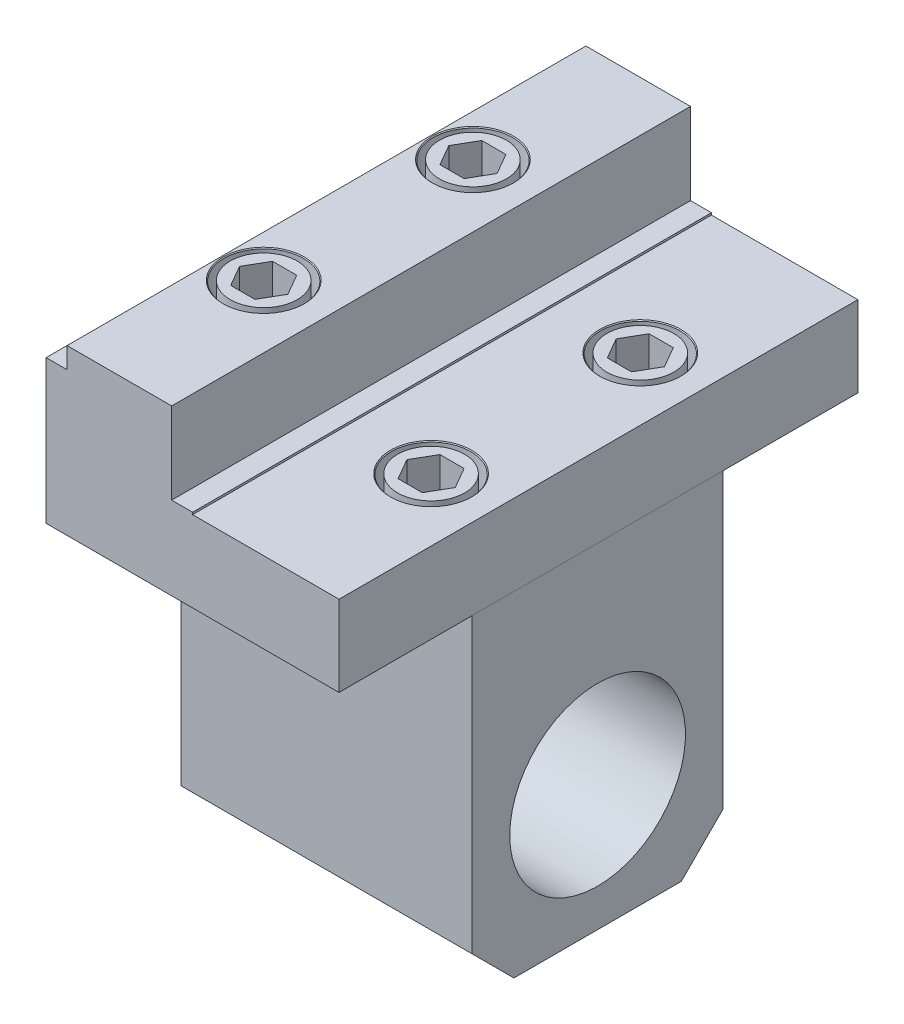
ISO-10303-21;
HEADER;
FILE_DESCRIPTION(('STEP AP214'),'2;1');
FILE_NAME('part.step','',(''),(''),'','','');
FILE_SCHEMA(('AUTOMOTIVE_DESIGN { 1 0 10303 214 1 1 1 1 }'));
ENDSEC;
DATA;
#1=APPLICATION_CONTEXT('core data for automotive mechanical design processes');
#2=APPLICATION_PROTOCOL_DEFINITION('international standard','automotive_design',2000,#1);
#3=PRODUCT_CONTEXT('',#1,'mechanical');
#4=PRODUCT('Part','Part','',(#3));
#5=PRODUCT_RELATED_PRODUCT_CATEGORY('part','',(#4));
#6=PRODUCT_DEFINITION_FORMATION('','',#4);
#7=PRODUCT_DEFINITION_CONTEXT('part definition',#1,'design');
#8=PRODUCT_DEFINITION('design','',#6,#7);
#9=PRODUCT_DEFINITION_SHAPE('','',#8);
#10=(LENGTH_UNIT() NAMED_UNIT(*) SI_UNIT(.MILLI.,.METRE.));
#11=(NAMED_UNIT(*) PLANE_ANGLE_UNIT() SI_UNIT($,.RADIAN.));
#12=(NAMED_UNIT(*) SI_UNIT($,.STERADIAN.) SOLID_ANGLE_UNIT());
#13=UNCERTAINTY_MEASURE_WITH_UNIT(LENGTH_MEASURE(1.E-05),#10,'distance_accuracy_value','');
#14=(GEOMETRIC_REPRESENTATION_CONTEXT(3) GLOBAL_UNCERTAINTY_ASSIGNED_CONTEXT((#13)) GLOBAL_UNIT_ASSIGNED_CONTEXT((#10,
#11,#12)) REPRESENTATION_CONTEXT('',''));
#15=CARTESIAN_POINT('',(0.,0.,0.));
#16=DIRECTION('',(0.,0.,1.));
#17=DIRECTION('',(1.,0.,0.));
#18=AXIS2_PLACEMENT_3D('',#15,#16,#17);
#19=CARTESIAN_POINT('',(0.200000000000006,-80.,-32.));
#20=DIRECTION('',(0.,0.,-1.));
#21=DIRECTION('',(-1.,0.,0.));
#22=AXIS2_PLACEMENT_3D('',#19,#20,#21);
#23=PLANE('',#22);
#24=DIRECTION('',(0.,1.,0.));
#25=VECTOR('',#24,1.);
#26=CARTESIAN_POINT('',(0.200000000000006,-80.,-32.));
#27=LINE('',#26,#25);
#28=CARTESIAN_POINT('',(0.200000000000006,-70.,-32.));
#29=VERTEX_POINT('',#28);
#30=CARTESIAN_POINT('',(0.200000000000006,0.,-32.));
#31=VERTEX_POINT('',#30);
#32=EDGE_CURVE('E100',#29,#31,#27,.T.);
#33=ORIENTED_EDGE('',*,*,#32,.F.);
#34=DIRECTION('',(1.,0.,0.));
#35=VECTOR('',#34,1.);
#36=CARTESIAN_POINT('',(0.200000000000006,-70.,-32.));
#37=LINE('',#36,#35);
#38=CARTESIAN_POINT('',(69.8,-70.,-32.));
#39=VERTEX_POINT('',#38);
#40=EDGE_CURVE('E13',#29,#39,#37,.T.);
#41=ORIENTED_EDGE('',*,*,#40,.T.);
#42=DIRECTION('',(0.,1.,0.));
#43=VECTOR('',#42,1.);
#44=CARTESIAN_POINT('',(69.8,-80.,-32.));
#45=LINE('',#44,#43);
#46=CARTESIAN_POINT('',(69.8,0.,-32.));
#47=VERTEX_POINT('',#46);
#48=EDGE_CURVE('E120',#39,#47,#45,.T.);
#49=ORIENTED_EDGE('',*,*,#48,.T.);
#50=DIRECTION('',(-1.,0.,0.));
#51=VECTOR('',#50,1.);
#52=CARTESIAN_POINT('',(0.200000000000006,0.,-32.));
#53=LINE('',#52,#51);
#54=EDGE_CURVE('E115',#47,#31,#53,.T.);
#55=ORIENTED_EDGE('',*,*,#54,.T.);
#56=EDGE_LOOP('',(#33,#41,#49,#55));
#57=FACE_BOUND('',#56,.T.);
#58=ADVANCED_FACE('F49',(#57),#23,.F.);
#59=CARTESIAN_POINT('',(0.200000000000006,-80.,-92.));
#60=DIRECTION('',(1.,0.,0.));
#61=DIRECTION('',(0.,0.,-1.));
#62=AXIS2_PLACEMENT_3D('',#59,#60,#61);
#63=PLANE('',#62);
#64=CARTESIAN_POINT('',(0.200000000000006,-50.0000000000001,-62.));
#65=DIRECTION('',(-1.,0.,0.));
#66=DIRECTION('',(0.,0.,1.));
#67=AXIS2_PLACEMENT_3D('',#64,#65,#66);
#68=CIRCLE('',#67,21.0000000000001);
#69=CARTESIAN_POINT('',(0.200000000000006,-50.0000000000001,-40.9999999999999));
#70=VERTEX_POINT('',#69);
#71=EDGE_CURVE('E125',#70,#70,#68,.T.);
#72=ORIENTED_EDGE('',*,*,#71,.F.);
#73=EDGE_LOOP('',(#72));
#74=FACE_BOUND('',#73,.T.);
#75=DIRECTION('',(0.,1.,0.));
#76=VECTOR('',#75,1.);
#77=CARTESIAN_POINT('',(0.200000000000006,-80.,-92.));
#78=LINE('',#77,#76);
#79=CARTESIAN_POINT('',(0.200000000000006,-70.,-92.));
#80=VERTEX_POINT('',#79);
#81=CARTESIAN_POINT('',(0.200000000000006,0.,-92.));
#82=VERTEX_POINT('',#81);
#83=EDGE_CURVE('E109',#80,#82,#78,.T.);
#84=ORIENTED_EDGE('',*,*,#83,.F.);
#85=DIRECTION('',(0.,0.707106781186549,-0.707106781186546));
#86=VECTOR('',#85,1.);
#87=CARTESIAN_POINT('',(0.200000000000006,-80.,-82.));
#88=LINE('',#87,#86);
#89=CARTESIAN_POINT('',(0.200000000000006,-80.,-82.));
#90=VERTEX_POINT('',#89);
#91=EDGE_CURVE('E57',#80,#90,#88,.F.);
#92=ORIENTED_EDGE('',*,*,#91,.T.);
#93=DIRECTION('',(0.,0.,-1.));
#94=VECTOR('',#93,1.);
#95=CARTESIAN_POINT('',(0.200000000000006,-80.,-92.));
#96=LINE('',#95,#94);
#97=CARTESIAN_POINT('',(0.200000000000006,-80.,-42.));
#98=VERTEX_POINT('',#97);
#99=EDGE_CURVE('E134',#98,#90,#96,.T.);
#100=ORIENTED_EDGE('',*,*,#99,.F.);
#101=DIRECTION('',(0.,-0.707106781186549,-0.707106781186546));
#102=VECTOR('',#101,1.);
#103=CARTESIAN_POINT('',(0.200000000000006,-80.,-42.));
#104=LINE('',#103,#102);
#105=EDGE_CURVE('E64',#98,#29,#104,.F.);
#106=ORIENTED_EDGE('',*,*,#105,.T.);
#107=ORIENTED_EDGE('',*,*,#32,.T.);
#108=DIRECTION('',(0.,0.,-1.));
#109=VECTOR('',#108,1.);
#110=CARTESIAN_POINT('',(0.200000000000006,0.,-92.));
#111=LINE('',#110,#109);
#112=EDGE_CURVE('E103',#31,#82,#111,.T.);
#113=ORIENTED_EDGE('',*,*,#112,.T.);
#114=EDGE_LOOP('',(#84,#92,#100,#106,#107,#113));
#115=FACE_BOUND('',#114,.T.);
#116=ADVANCED_FACE('F102',(#74,#115),#63,.F.);
#117=CARTESIAN_POINT('',(69.8,-80.,-92.));
#118=DIRECTION('',(0.,0.,1.));
#119=DIRECTION('',(1.,0.,0.));
#120=AXIS2_PLACEMENT_3D('',#117,#118,#119);
#121=PLANE('',#120);
#122=DIRECTION('',(0.,1.,0.));
#123=VECTOR('',#122,1.);
#124=CARTESIAN_POINT('',(69.8,-80.,-92.));
#125=LINE('',#124,#123);
#126=CARTESIAN_POINT('',(69.8,-70.,-92.));
#127=VERTEX_POINT('',#126);
#128=CARTESIAN_POINT('',(69.8,0.,-92.));
#129=VERTEX_POINT('',#128);
#130=EDGE_CURVE('E136',#127,#129,#125,.T.);
#131=ORIENTED_EDGE('',*,*,#130,.F.);
#132=DIRECTION('',(-1.,0.,0.));
#133=VECTOR('',#132,1.);
#134=CARTESIAN_POINT('',(69.8,-70.,-92.));
#135=LINE('',#134,#133);
#136=EDGE_CURVE('E72',#127,#80,#135,.T.);
#137=ORIENTED_EDGE('',*,*,#136,.T.);
#138=ORIENTED_EDGE('',*,*,#83,.T.);
#139=DIRECTION('',(1.,0.,0.));
#140=VECTOR('',#139,1.);
#141=CARTESIAN_POINT('',(69.8,0.,-92.));
#142=LINE('',#141,#140);
#143=EDGE_CURVE('E117',#82,#129,#142,.T.);
#144=ORIENTED_EDGE('',*,*,#143,.T.);
#145=EDGE_LOOP('',(#131,#137,#138,#144));
#146=FACE_BOUND('',#145,.T.);
#147=ADVANCED_FACE('F161',(#146),#121,.F.);
#148=CARTESIAN_POINT('',(69.8,-80.,-32.));
#149=DIRECTION('',(-1.,0.,0.));
#150=DIRECTION('',(0.,0.,1.));
#151=AXIS2_PLACEMENT_3D('',#148,#149,#150);
#152=PLANE('',#151);
#153=CARTESIAN_POINT('',(69.8,-50.0000000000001,-62.));
#154=DIRECTION('',(-1.,0.,0.));
#155=DIRECTION('',(0.,0.,1.));
#156=AXIS2_PLACEMENT_3D('',#153,#154,#155);
#157=CIRCLE('',#156,21.0000000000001);
#158=CARTESIAN_POINT('',(69.8,-50.0000000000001,-40.9999999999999));
#159=VERTEX_POINT('',#158);
#160=EDGE_CURVE('E122',#159,#159,#157,.T.);
#161=ORIENTED_EDGE('',*,*,#160,.T.);
#162=EDGE_LOOP('',(#161));
#163=FACE_BOUND('',#162,.T.);
#164=DIRECTION('',(0.,0.,1.));
#165=VECTOR('',#164,1.);
#166=CARTESIAN_POINT('',(69.8,-80.,-32.));
#167=LINE('',#166,#165);
#168=CARTESIAN_POINT('',(69.8,-80.,-82.));
#169=VERTEX_POINT('',#168);
#170=CARTESIAN_POINT('',(69.8,-80.,-42.));
#171=VERTEX_POINT('',#170);
#172=EDGE_CURVE('E128',#169,#171,#167,.T.);
#173=ORIENTED_EDGE('',*,*,#172,.F.);
#174=DIRECTION('',(0.,-0.707106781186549,0.707106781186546));
#175=VECTOR('',#174,1.);
#176=CARTESIAN_POINT('',(69.8,-80.,-82.));
#177=LINE('',#176,#175);
#178=EDGE_CURVE('E146',#169,#127,#177,.F.);
#179=ORIENTED_EDGE('',*,*,#178,.T.);
#180=ORIENTED_EDGE('',*,*,#130,.T.);
#181=DIRECTION('',(0.,0.,1.));
#182=VECTOR('',#181,1.);
#183=CARTESIAN_POINT('',(69.8,0.,-32.));
#184=LINE('',#183,#182);
#185=EDGE_CURVE('E132',#129,#47,#184,.T.);
#186=ORIENTED_EDGE('',*,*,#185,.T.);
#187=ORIENTED_EDGE('',*,*,#48,.F.);
#188=DIRECTION('',(0.,0.707106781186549,0.707106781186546));
#189=VECTOR('',#188,1.);
#190=CARTESIAN_POINT('',(69.8,-80.,-42.));
#191=LINE('',#190,#189);
#192=EDGE_CURVE('E144',#39,#171,#191,.F.);
#193=ORIENTED_EDGE('',*,*,#192,.T.);
#194=EDGE_LOOP('',(#173,#179,#180,#186,#187,#193));
#195=FACE_BOUND('',#194,.T.);
#196=ADVANCED_FACE('F160',(#163,#195),#152,.F.);
#197=CARTESIAN_POINT('',(69.8,-80.,-32.));
#198=DIRECTION('',(0.,1.,0.));
#199=DIRECTION('',(0.,0.,1.));
#200=AXIS2_PLACEMENT_3D('',#197,#198,#199);
#201=PLANE('',#200);
#202=ORIENTED_EDGE('',*,*,#99,.T.);
#203=DIRECTION('',(1.,0.,0.));
#204=VECTOR('',#203,1.);
#205=CARTESIAN_POINT('',(69.8,-80.,-82.));
#206=LINE('',#205,#204);
#207=EDGE_CURVE('E141',#90,#169,#206,.T.);
#208=ORIENTED_EDGE('',*,*,#207,.T.);
#209=ORIENTED_EDGE('',*,*,#172,.T.);
#210=DIRECTION('',(-1.,0.,0.));
#211=VECTOR('',#210,1.);
#212=CARTESIAN_POINT('',(69.8,-80.,-42.));
#213=LINE('',#212,#211);
#214=EDGE_CURVE('E108',#171,#98,#213,.T.);
#215=ORIENTED_EDGE('',*,*,#214,.T.);
#216=EDGE_LOOP('',(#202,#208,#209,#215));
#217=FACE_BOUND('',#216,.T.);
#218=ADVANCED_FACE('F154',(#217),#201,.F.);
#219=CARTESIAN_POINT('',(69.8,0.,-32.));
#220=DIRECTION('',(0.,1.,0.));
#221=DIRECTION('',(0.,0.,1.));
#222=AXIS2_PLACEMENT_3D('',#219,#220,#221);
#223=PLANE('',#222);
#224=ORIENTED_EDGE('',*,*,#54,.F.);
#225=ORIENTED_EDGE('',*,*,#185,.F.);
#226=ORIENTED_EDGE('',*,*,#143,.F.);
#227=ORIENTED_EDGE('',*,*,#112,.F.);
#228=EDGE_LOOP('',(#224,#225,#226,#227));
#229=FACE_BOUND('',#228,.T.);
#230=ADVANCED_FACE('F113',(#229),#223,.T.);
#231=CARTESIAN_POINT('',(70.,-50.0000000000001,-62.));
#232=DIRECTION('',(-1.,0.,0.));
#233=DIRECTION('',(0.,0.,1.));
#234=AXIS2_PLACEMENT_3D('',#231,#232,#233);
#235=CYLINDRICAL_SURFACE('',#234,21.0000000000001);
#236=ORIENTED_EDGE('',*,*,#71,.T.);
#237=EDGE_LOOP('',(#236));
#238=FACE_BOUND('',#237,.T.);
#239=ORIENTED_EDGE('',*,*,#160,.F.);
#240=EDGE_LOOP('',(#239));
#241=FACE_BOUND('',#240,.T.);
#242=ADVANCED_FACE('F168',(#238,#241),#235,.F.);
#243=CARTESIAN_POINT('',(69.8,-80.,-82.));
#244=DIRECTION('',(0.,0.707106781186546,0.707106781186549));
#245=DIRECTION('',(0.,-0.707106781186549,0.707106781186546));
#246=AXIS2_PLACEMENT_3D('',#243,#244,#245);
#247=PLANE('',#246);
#248=ORIENTED_EDGE('',*,*,#91,.F.);
#249=ORIENTED_EDGE('',*,*,#136,.F.);
#250=ORIENTED_EDGE('',*,*,#178,.F.);
#251=ORIENTED_EDGE('',*,*,#207,.F.);
#252=EDGE_LOOP('',(#248,#249,#250,#251));
#253=FACE_BOUND('',#252,.T.);
#254=ADVANCED_FACE('F158',(#253),#247,.F.);
#255=CARTESIAN_POINT('',(69.8,-80.,-42.));
#256=DIRECTION('',(0.,0.707106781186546,-0.707106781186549));
#257=DIRECTION('',(0.,0.707106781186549,0.707106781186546));
#258=AXIS2_PLACEMENT_3D('',#255,#256,#257);
#259=PLANE('',#258);
#260=ORIENTED_EDGE('',*,*,#192,.F.);
#261=ORIENTED_EDGE('',*,*,#40,.F.);
#262=ORIENTED_EDGE('',*,*,#105,.F.);
#263=ORIENTED_EDGE('',*,*,#214,.F.);
#264=EDGE_LOOP('',(#260,#261,#262,#263));
#265=FACE_BOUND('',#264,.T.);
#266=ADVANCED_FACE('F51',(#265),#259,.F.);
#267=CLOSED_SHELL('',(#58,#116,#147,#196,#218,#230,#242,#254,#266));
#268=MANIFOLD_SOLID_BREP('B2',#267);
#269=CARTESIAN_POINT('',(55.,0.,-87.));
#270=DIRECTION('',(0.,1.,0.));
#271=DIRECTION('',(0.,0.,1.));
#272=AXIS2_PLACEMENT_3D('',#269,#270,#271);
#273=CYLINDRICAL_SURFACE('',#272,5.5);
#274=CARTESIAN_POINT('',(55.,0.199999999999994,-87.));
#275=DIRECTION('',(0.,-1.,0.));
#276=DIRECTION('',(0.,0.,-1.));
#277=AXIS2_PLACEMENT_3D('',#274,#275,#276);
#278=CIRCLE('',#277,5.5);
#279=CARTESIAN_POINT('',(55.,0.199999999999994,-92.5));
#280=VERTEX_POINT('',#279);
#281=EDGE_CURVE('E781',#280,#280,#278,.T.);
#282=ORIENTED_EDGE('',*,*,#281,.T.);
#283=EDGE_LOOP('',(#282));
#284=FACE_BOUND('',#283,.T.);
#285=CARTESIAN_POINT('',(55.,9.,-87.));
#286=DIRECTION('',(0.,1.,0.));
#287=DIRECTION('',(0.,0.,1.));
#288=AXIS2_PLACEMENT_3D('',#285,#286,#287);
#289=CIRCLE('',#288,5.5);
#290=CARTESIAN_POINT('',(55.,9.,-81.5));
#291=VERTEX_POINT('',#290);
#292=EDGE_CURVE('E47',#291,#291,#289,.F.);
#293=ORIENTED_EDGE('',*,*,#292,.F.);
#294=EDGE_LOOP('',(#293));
#295=FACE_BOUND('',#294,.T.);
#296=ADVANCED_FACE('F265',(#284,#295),#273,.F.);
#297=CARTESIAN_POINT('',(55.,10.,-87.));
#298=DIRECTION('',(0.,1.,0.));
#299=DIRECTION('',(0.,0.,1.));
#300=AXIS2_PLACEMENT_3D('',#297,#298,#299);
#301=PLANE('',#300);
#302=DIRECTION('',(-0.500000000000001,0.,0.866025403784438));
#303=VECTOR('',#302,1.);
#304=CARTESIAN_POINT('',(50.6698729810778,10.,-89.5));
#305=LINE('',#304,#303);
#306=CARTESIAN_POINT('',(52.1132486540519,10.,-92.));
#307=VERTEX_POINT('',#306);
#308=CARTESIAN_POINT('',(49.2264973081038,10.,-87.));
#309=VERTEX_POINT('',#308);
#310=EDGE_CURVE('E280',#307,#309,#305,.T.);
#311=ORIENTED_EDGE('',*,*,#310,.T.);
#312=DIRECTION('',(0.5,0.,0.866025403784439));
#313=VECTOR('',#312,1.);
#314=CARTESIAN_POINT('',(50.6698729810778,10.,-84.5));
#315=LINE('',#314,#313);
#316=CARTESIAN_POINT('',(52.1132486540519,10.,-82.));
#317=VERTEX_POINT('',#316);
#318=EDGE_CURVE('E504',#309,#317,#315,.T.);
#319=ORIENTED_EDGE('',*,*,#318,.T.);
#320=DIRECTION('',(1.,0.,0.));
#321=VECTOR('',#320,1.);
#322=CARTESIAN_POINT('',(55.,10.,-82.));
#323=LINE('',#322,#321);
#324=CARTESIAN_POINT('',(57.8867513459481,10.,-82.));
#325=VERTEX_POINT('',#324);
#326=EDGE_CURVE('E873',#317,#325,#323,.T.);
#327=ORIENTED_EDGE('',*,*,#326,.T.);
#328=DIRECTION('',(0.5,0.,-0.866025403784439));
#329=VECTOR('',#328,1.);
#330=CARTESIAN_POINT('',(59.3301270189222,10.,-84.5));
#331=LINE('',#330,#329);
#332=CARTESIAN_POINT('',(60.7735026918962,10.,-87.));
#333=VERTEX_POINT('',#332);
#334=EDGE_CURVE('E871',#325,#333,#331,.T.);
#335=ORIENTED_EDGE('',*,*,#334,.T.);
#336=DIRECTION('',(-0.500000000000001,0.,-0.866025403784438));
#337=VECTOR('',#336,1.);
#338=CARTESIAN_POINT('',(59.3301270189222,10.,-89.5));
#339=LINE('',#338,#337);
#340=CARTESIAN_POINT('',(57.8867513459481,10.,-92.));
#341=VERTEX_POINT('',#340);
#342=EDGE_CURVE('E869',#333,#341,#339,.T.);
#343=ORIENTED_EDGE('',*,*,#342,.T.);
#344=DIRECTION('',(-1.,0.,0.));
#345=VECTOR('',#344,1.);
#346=CARTESIAN_POINT('',(55.,10.,-92.));
#347=LINE('',#346,#345);
#348=EDGE_CURVE('E866',#341,#307,#347,.T.);
#349=ORIENTED_EDGE('',*,*,#348,.T.);
#350=EDGE_LOOP('',(#311,#319,#327,#335,#343,#349));
#351=FACE_BOUND('',#350,.T.);
#352=ADVANCED_FACE('F900',(#351),#301,.T.);
#353=CARTESIAN_POINT('',(55.,10.,-37.));
#354=DIRECTION('',(0.,1.,0.));
#355=DIRECTION('',(0.,0.,1.));
#356=AXIS2_PLACEMENT_3D('',#353,#354,#355);
#357=PLANE('',#356);
#358=DIRECTION('',(1.,0.,0.));
#359=VECTOR('',#358,1.);
#360=CARTESIAN_POINT('',(55.,10.,-32.));
#361=LINE('',#360,#359);
#362=CARTESIAN_POINT('',(52.1132486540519,10.,-32.));
#363=VERTEX_POINT('',#362);
#364=CARTESIAN_POINT('',(57.8867513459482,10.,-32.));
#365=VERTEX_POINT('',#364);
#366=EDGE_CURVE('E288',#363,#365,#361,.T.);
#367=ORIENTED_EDGE('',*,*,#366,.T.);
#368=DIRECTION('',(0.499999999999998,0.,-0.86602540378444));
#369=VECTOR('',#368,1.);
#370=CARTESIAN_POINT('',(59.3301270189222,10.,-34.5));
#371=LINE('',#370,#369);
#372=CARTESIAN_POINT('',(60.7735026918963,10.,-37.));
#373=VERTEX_POINT('',#372);
#374=EDGE_CURVE('E849',#365,#373,#371,.T.);
#375=ORIENTED_EDGE('',*,*,#374,.T.);
#376=DIRECTION('',(-0.499999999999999,0.,-0.866025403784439));
#377=VECTOR('',#376,1.);
#378=CARTESIAN_POINT('',(59.3301270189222,10.,-39.5));
#379=LINE('',#378,#377);
#380=CARTESIAN_POINT('',(57.8867513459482,10.,-42.));
#381=VERTEX_POINT('',#380);
#382=EDGE_CURVE('E860',#373,#381,#379,.T.);
#383=ORIENTED_EDGE('',*,*,#382,.T.);
#384=DIRECTION('',(-1.,0.,0.));
#385=VECTOR('',#384,1.);
#386=CARTESIAN_POINT('',(55.,10.,-42.));
#387=LINE('',#386,#385);
#388=CARTESIAN_POINT('',(52.1132486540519,10.,-42.));
#389=VERTEX_POINT('',#388);
#390=EDGE_CURVE('E858',#381,#389,#387,.T.);
#391=ORIENTED_EDGE('',*,*,#390,.T.);
#392=DIRECTION('',(-0.499999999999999,0.,0.866025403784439));
#393=VECTOR('',#392,1.);
#394=CARTESIAN_POINT('',(50.6698729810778,10.,-39.5));
#395=LINE('',#394,#393);
#396=CARTESIAN_POINT('',(49.2264973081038,10.,-37.));
#397=VERTEX_POINT('',#396);
#398=EDGE_CURVE('E856',#389,#397,#395,.T.);
#399=ORIENTED_EDGE('',*,*,#398,.T.);
#400=DIRECTION('',(0.499999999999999,0.,0.866025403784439));
#401=VECTOR('',#400,1.);
#402=CARTESIAN_POINT('',(50.6698729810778,10.,-34.5));
#403=LINE('',#402,#401);
#404=EDGE_CURVE('E853',#397,#363,#403,.T.);
#405=ORIENTED_EDGE('',*,*,#404,.T.);
#406=EDGE_LOOP('',(#367,#375,#383,#391,#399,#405));
#407=FACE_BOUND('',#406,.T.);
#408=ADVANCED_FACE('F906',(#407),#357,.T.);
#409=CARTESIAN_POINT('',(15.,0.,-37.));
#410=DIRECTION('',(0.,1.,0.));
#411=DIRECTION('',(0.,0.,1.));
#412=AXIS2_PLACEMENT_3D('',#409,#410,#411);
#413=CYLINDRICAL_SURFACE('',#412,5.5);
#414=CARTESIAN_POINT('',(15.,0.200000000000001,-37.));
#415=DIRECTION('',(0.,-1.,0.));
#416=DIRECTION('',(0.,0.,-1.));
#417=AXIS2_PLACEMENT_3D('',#414,#415,#416);
#418=CIRCLE('',#417,5.5);
#419=CARTESIAN_POINT('',(15.,0.200000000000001,-42.5));
#420=VERTEX_POINT('',#419);
#421=EDGE_CURVE('E784',#420,#420,#418,.T.);
#422=ORIENTED_EDGE('',*,*,#421,.T.);
#423=EDGE_LOOP('',(#422));
#424=FACE_BOUND('',#423,.T.);
#425=CARTESIAN_POINT('',(15.,28.5,-37.));
#426=DIRECTION('',(0.,1.,0.));
#427=DIRECTION('',(0.,0.,1.));
#428=AXIS2_PLACEMENT_3D('',#425,#426,#427);
#429=CIRCLE('',#428,5.5);
#430=CARTESIAN_POINT('',(15.,28.5,-31.5));
#431=VERTEX_POINT('',#430);
#432=EDGE_CURVE('E846',#431,#431,#429,.F.);
#433=ORIENTED_EDGE('',*,*,#432,.F.);
#434=EDGE_LOOP('',(#433));
#435=FACE_BOUND('',#434,.T.);
#436=ADVANCED_FACE('F1019',(#424,#435),#413,.F.);
#437=CARTESIAN_POINT('',(15.,29.5,-87.));
#438=DIRECTION('',(0.,1.,0.));
#439=DIRECTION('',(0.,0.,1.));
#440=AXIS2_PLACEMENT_3D('',#437,#438,#439);
#441=PLANE('',#440);
#442=CARTESIAN_POINT('',(15.,29.5,-87.));
#443=DIRECTION('',(0.,1.,0.));
#444=DIRECTION('',(0.,0.,1.));
#445=AXIS2_PLACEMENT_3D('',#442,#443,#444);
#446=CIRCLE('',#445,9.50000000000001);
#447=CARTESIAN_POINT('',(15.,29.5,-77.5));
#448=VERTEX_POINT('',#447);
#449=EDGE_CURVE('E690',#448,#448,#446,.T.);
#450=ORIENTED_EDGE('',*,*,#449,.T.);
#451=EDGE_LOOP('',(#450));
#452=FACE_BOUND('',#451,.T.);
#453=CARTESIAN_POINT('',(15.,29.5,-87.));
#454=DIRECTION('',(0.,1.,0.));
#455=DIRECTION('',(0.,0.,-1.));
#456=AXIS2_PLACEMENT_3D('',#453,#454,#455);
#457=CIRCLE('',#456,8.);
#458=CARTESIAN_POINT('',(15.,29.5,-95.));
#459=VERTEX_POINT('',#458);
#460=EDGE_CURVE('E621',#459,#459,#457,.T.);
#461=ORIENTED_EDGE('',*,*,#460,.F.);
#462=EDGE_LOOP('',(#461));
#463=FACE_BOUND('',#462,.T.);
#464=ADVANCED_FACE('F1016',(#452,#463),#441,.T.);
#465=CARTESIAN_POINT('',(15.,29.5,-37.));
#466=DIRECTION('',(0.,1.,0.));
#467=DIRECTION('',(0.,0.,1.));
#468=AXIS2_PLACEMENT_3D('',#465,#466,#467);
#469=PLANE('',#468);
#470=CARTESIAN_POINT('',(15.,29.5,-37.));
#471=DIRECTION('',(0.,1.,0.));
#472=DIRECTION('',(0.,0.,1.));
#473=AXIS2_PLACEMENT_3D('',#470,#471,#472);
#474=CIRCLE('',#473,9.50000000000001);
#475=CARTESIAN_POINT('',(15.,29.5,-27.5));
#476=VERTEX_POINT('',#475);
#477=EDGE_CURVE('E686',#476,#476,#474,.T.);
#478=ORIENTED_EDGE('',*,*,#477,.T.);
#479=EDGE_LOOP('',(#478));
#480=FACE_BOUND('',#479,.T.);
#481=CARTESIAN_POINT('',(15.,29.5,-37.));
#482=DIRECTION('',(0.,1.,0.));
#483=DIRECTION('',(0.,0.,1.));
#484=AXIS2_PLACEMENT_3D('',#481,#482,#483);
#485=CIRCLE('',#484,8.);
#486=CARTESIAN_POINT('',(15.,29.5,-29.));
#487=VERTEX_POINT('',#486);
#488=EDGE_CURVE('E663',#487,#487,#485,.T.);
#489=ORIENTED_EDGE('',*,*,#488,.F.);
#490=EDGE_LOOP('',(#489));
#491=FACE_BOUND('',#490,.T.);
#492=ADVANCED_FACE('F951',(#480,#491),#469,.T.);
#493=CARTESIAN_POINT('',(70.,20.,-124.));
#494=DIRECTION('',(1.,0.,0.));
#495=DIRECTION('',(0.,0.,-1.));
#496=AXIS2_PLACEMENT_3D('',#493,#494,#495);
#497=PLANE('',#496);
#498=DIRECTION('',(0.,1.,0.));
#499=VECTOR('',#498,1.);
#500=CARTESIAN_POINT('',(70.,20.,0.));
#501=LINE('',#500,#499);
#502=CARTESIAN_POINT('',(70.,0.200000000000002,0.));
#503=VERTEX_POINT('',#502);
#504=CARTESIAN_POINT('',(70.,19.5,0.));
#505=VERTEX_POINT('',#504);
#506=EDGE_CURVE('E699',#503,#505,#501,.T.);
#507=ORIENTED_EDGE('',*,*,#506,.F.);
#508=DIRECTION('',(0.,0.,-1.));
#509=VECTOR('',#508,1.);
#510=CARTESIAN_POINT('',(70.,0.199999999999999,-124.));
#511=LINE('',#510,#509);
#512=CARTESIAN_POINT('',(70.,0.200000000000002,-124.));
#513=VERTEX_POINT('',#512);
#514=EDGE_CURVE('E772',#503,#513,#511,.T.);
#515=ORIENTED_EDGE('',*,*,#514,.T.);
#516=DIRECTION('',(0.,1.,0.));
#517=VECTOR('',#516,1.);
#518=CARTESIAN_POINT('',(70.,20.,-124.));
#519=LINE('',#518,#517);
#520=CARTESIAN_POINT('',(70.,19.5,-124.));
#521=VERTEX_POINT('',#520);
#522=EDGE_CURVE('E700',#513,#521,#519,.T.);
#523=ORIENTED_EDGE('',*,*,#522,.T.);
#524=DIRECTION('',(0.,0.,-1.));
#525=VECTOR('',#524,1.);
#526=CARTESIAN_POINT('',(70.,19.5,0.));
#527=LINE('',#526,#525);
#528=EDGE_CURVE('E668',#505,#521,#527,.T.);
#529=ORIENTED_EDGE('',*,*,#528,.F.);
#530=EDGE_LOOP('',(#507,#515,#523,#529));
#531=FACE_BOUND('',#530,.T.);
#532=ADVANCED_FACE('F947',(#531),#497,.T.);
#533=CARTESIAN_POINT('',(55.,10.,-87.));
#534=DIRECTION('',(0.,1.,0.));
#535=DIRECTION('',(0.,0.,1.));
#536=AXIS2_PLACEMENT_3D('',#533,#534,#535);
#537=CYLINDRICAL_SURFACE('',#536,9.49999999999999);
#538=CARTESIAN_POINT('',(55.,19.3,-87.));
#539=DIRECTION('',(0.,1.,0.));
#540=DIRECTION('',(0.,0.,1.));
#541=AXIS2_PLACEMENT_3D('',#538,#539,#540);
#542=CIRCLE('',#541,9.49999999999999);
#543=CARTESIAN_POINT('',(55.,19.3,-77.5));
#544=VERTEX_POINT('',#543);
#545=EDGE_CURVE('E799',#544,#544,#542,.T.);
#546=ORIENTED_EDGE('',*,*,#545,.T.);
#547=EDGE_LOOP('',(#546));
#548=FACE_BOUND('',#547,.T.);
#549=CARTESIAN_POINT('',(55.,10.,-87.));
#550=DIRECTION('',(0.,1.,0.));
#551=DIRECTION('',(0.,0.,1.));
#552=AXIS2_PLACEMENT_3D('',#549,#550,#551);
#553=CIRCLE('',#552,9.49999999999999);
#554=CARTESIAN_POINT('',(55.,10.,-77.5));
#555=VERTEX_POINT('',#554);
#556=EDGE_CURVE('E696',#555,#555,#553,.T.);
#557=ORIENTED_EDGE('',*,*,#556,.F.);
#558=EDGE_LOOP('',(#557));
#559=FACE_BOUND('',#558,.T.);
#560=ADVANCED_FACE('F950',(#548,#559),#537,.F.);
#561=CARTESIAN_POINT('',(55.,10.,-37.));
#562=DIRECTION('',(0.,1.,0.));
#563=DIRECTION('',(0.,0.,1.));
#564=AXIS2_PLACEMENT_3D('',#561,#562,#563);
#565=CYLINDRICAL_SURFACE('',#564,9.5);
#566=CARTESIAN_POINT('',(55.,19.3,-37.));
#567=DIRECTION('',(0.,1.,0.));
#568=DIRECTION('',(0.,0.,1.));
#569=AXIS2_PLACEMENT_3D('',#566,#567,#568);
#570=CIRCLE('',#569,9.5);
#571=CARTESIAN_POINT('',(55.,19.3,-27.5));
#572=VERTEX_POINT('',#571);
#573=EDGE_CURVE('E796',#572,#572,#570,.T.);
#574=ORIENTED_EDGE('',*,*,#573,.T.);
#575=EDGE_LOOP('',(#574));
#576=FACE_BOUND('',#575,.T.);
#577=CARTESIAN_POINT('',(55.,10.,-37.));
#578=DIRECTION('',(0.,1.,0.));
#579=DIRECTION('',(0.,0.,1.));
#580=AXIS2_PLACEMENT_3D('',#577,#578,#579);
#581=CIRCLE('',#580,9.5);
#582=CARTESIAN_POINT('',(55.,10.,-27.5));
#583=VERTEX_POINT('',#582);
#584=EDGE_CURVE('E693',#583,#583,#581,.T.);
#585=ORIENTED_EDGE('',*,*,#584,.F.);
#586=EDGE_LOOP('',(#585));
#587=FACE_BOUND('',#586,.T.);
#588=ADVANCED_FACE('F1117',(#576,#587),#565,.F.);
#589=CARTESIAN_POINT('',(15.,0.,-87.));
#590=DIRECTION('',(0.,1.,0.));
#591=DIRECTION('',(0.,0.,1.));
#592=AXIS2_PLACEMENT_3D('',#589,#590,#591);
#593=CYLINDRICAL_SURFACE('',#592,5.5);
#594=CARTESIAN_POINT('',(15.,28.5,-87.));
#595=DIRECTION('',(0.,-1.,0.));
#596=DIRECTION('',(0.,0.,-1.));
#597=AXIS2_PLACEMENT_3D('',#594,#595,#596);
#598=CIRCLE('',#597,5.5);
#599=CARTESIAN_POINT('',(15.,28.5,-92.5));
#600=VERTEX_POINT('',#599);
#601=EDGE_CURVE('E559',#600,#600,#598,.F.);
#602=ORIENTED_EDGE('',*,*,#601,.T.);
#603=EDGE_LOOP('',(#602));
#604=FACE_BOUND('',#603,.T.);
#605=CARTESIAN_POINT('',(15.,0.200000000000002,-87.));
#606=DIRECTION('',(0.,-1.,0.));
#607=DIRECTION('',(0.,0.,-1.));
#608=AXIS2_PLACEMENT_3D('',#605,#606,#607);
#609=CIRCLE('',#608,5.5);
#610=CARTESIAN_POINT('',(15.,0.200000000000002,-92.5));
#611=VERTEX_POINT('',#610);
#612=EDGE_CURVE('E778',#611,#611,#609,.T.);
#613=ORIENTED_EDGE('',*,*,#612,.T.);
#614=EDGE_LOOP('',(#613));
#615=FACE_BOUND('',#614,.T.);
#616=ADVANCED_FACE('F1119',(#604,#615),#593,.F.);
#617=CARTESIAN_POINT('',(55.,0.,-37.));
#618=DIRECTION('',(0.,1.,0.));
#619=DIRECTION('',(0.,0.,1.));
#620=AXIS2_PLACEMENT_3D('',#617,#618,#619);
#621=CYLINDRICAL_SURFACE('',#620,5.5);
#622=CARTESIAN_POINT('',(55.,9.,-37.));
#623=DIRECTION('',(0.,-1.,0.));
#624=DIRECTION('',(0.,0.,-1.));
#625=AXIS2_PLACEMENT_3D('',#622,#623,#624);
#626=CIRCLE('',#625,5.5);
#627=CARTESIAN_POINT('',(55.,9.,-42.5));
#628=VERTEX_POINT('',#627);
#629=EDGE_CURVE('E876',#628,#628,#626,.F.);
#630=ORIENTED_EDGE('',*,*,#629,.T.);
#631=EDGE_LOOP('',(#630));
#632=FACE_BOUND('',#631,.T.);
#633=CARTESIAN_POINT('',(55.,0.200000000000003,-37.));
#634=DIRECTION('',(0.,-1.,0.));
#635=DIRECTION('',(0.,0.,-1.));
#636=AXIS2_PLACEMENT_3D('',#633,#634,#635);
#637=CIRCLE('',#636,5.5);
#638=CARTESIAN_POINT('',(55.,0.200000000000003,-42.5));
#639=VERTEX_POINT('',#638);
#640=EDGE_CURVE('E787',#639,#639,#637,.T.);
#641=ORIENTED_EDGE('',*,*,#640,.T.);
#642=EDGE_LOOP('',(#641));
#643=FACE_BOUND('',#642,.T.);
#644=ADVANCED_FACE('F912',(#632,#643),#621,.F.);
#645=CARTESIAN_POINT('',(70.,0.,-124.));
#646=DIRECTION('',(0.,-1.,0.));
#647=DIRECTION('',(0.,0.,-1.));
#648=AXIS2_PLACEMENT_3D('',#645,#646,#647);
#649=PLANE('',#648);
#650=DIRECTION('',(0.,0.,-1.));
#651=VECTOR('',#650,1.);
#652=CARTESIAN_POINT('',(0.200000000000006,0.,-124.));
#653=LINE('',#652,#651);
#654=CARTESIAN_POINT('',(0.200000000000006,0.,-0.200000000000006));
#655=VERTEX_POINT('',#654);
#656=CARTESIAN_POINT('',(0.200000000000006,0.,-123.8));
#657=VERTEX_POINT('',#656);
#658=EDGE_CURVE('E760',#655,#657,#653,.T.);
#659=ORIENTED_EDGE('',*,*,#658,.T.);
#660=DIRECTION('',(1.,0.,0.));
#661=VECTOR('',#660,1.);
#662=CARTESIAN_POINT('',(70.,0.,-123.8));
#663=LINE('',#662,#661);
#664=CARTESIAN_POINT('',(69.8,0.,-123.8));
#665=VERTEX_POINT('',#664);
#666=EDGE_CURVE('E766',#657,#665,#663,.T.);
#667=ORIENTED_EDGE('',*,*,#666,.T.);
#668=DIRECTION('',(0.,0.,1.));
#669=VECTOR('',#668,1.);
#670=CARTESIAN_POINT('',(69.8,0.,-124.));
#671=LINE('',#670,#669);
#672=CARTESIAN_POINT('',(69.8,0.,-0.200000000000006));
#673=VERTEX_POINT('',#672);
#674=EDGE_CURVE('E764',#665,#673,#671,.T.);
#675=ORIENTED_EDGE('',*,*,#674,.T.);
#676=DIRECTION('',(-1.,0.,0.));
#677=VECTOR('',#676,1.);
#678=CARTESIAN_POINT('',(0.,0.,-0.200000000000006));
#679=LINE('',#678,#677);
#680=EDGE_CURVE('E762',#673,#655,#679,.T.);
#681=ORIENTED_EDGE('',*,*,#680,.T.);
#682=EDGE_LOOP('',(#659,#667,#675,#681));
#683=FACE_BOUND('',#682,.T.);
#684=CARTESIAN_POINT('',(15.,0.,-87.));
#685=DIRECTION('',(0.,-1.,0.));
#686=DIRECTION('',(0.,0.,-1.));
#687=AXIS2_PLACEMENT_3D('',#684,#685,#686);
#688=CIRCLE('',#687,5.70000000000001);
#689=CARTESIAN_POINT('',(15.,0.,-92.7));
#690=VERTEX_POINT('',#689);
#691=EDGE_CURVE('E757',#690,#690,#688,.F.);
#692=ORIENTED_EDGE('',*,*,#691,.T.);
#693=EDGE_LOOP('',(#692));
#694=FACE_BOUND('',#693,.T.);
#695=CARTESIAN_POINT('',(55.,0.,-87.));
#696=DIRECTION('',(0.,-1.,0.));
#697=DIRECTION('',(0.,0.,-1.));
#698=AXIS2_PLACEMENT_3D('',#695,#696,#697);
#699=CIRCLE('',#698,5.7);
#700=CARTESIAN_POINT('',(55.,0.,-92.7));
#701=VERTEX_POINT('',#700);
#702=EDGE_CURVE('E754',#701,#701,#699,.F.);
#703=ORIENTED_EDGE('',*,*,#702,.T.);
#704=EDGE_LOOP('',(#703));
#705=FACE_BOUND('',#704,.T.);
#706=CARTESIAN_POINT('',(15.,0.,-37.));
#707=DIRECTION('',(0.,-1.,0.));
#708=DIRECTION('',(0.,0.,-1.));
#709=AXIS2_PLACEMENT_3D('',#706,#707,#708);
#710=CIRCLE('',#709,5.7);
#711=CARTESIAN_POINT('',(15.,0.,-42.7));
#712=VERTEX_POINT('',#711);
#713=EDGE_CURVE('E751',#712,#712,#710,.F.);
#714=ORIENTED_EDGE('',*,*,#713,.T.);
#715=EDGE_LOOP('',(#714));
#716=FACE_BOUND('',#715,.T.);
#717=CARTESIAN_POINT('',(55.,0.,-37.));
#718=DIRECTION('',(0.,-1.,0.));
#719=DIRECTION('',(0.,0.,-1.));
#720=AXIS2_PLACEMENT_3D('',#717,#718,#719);
#721=CIRCLE('',#720,5.7);
#722=CARTESIAN_POINT('',(55.,0.,-42.7));
#723=VERTEX_POINT('',#722);
#724=EDGE_CURVE('E740',#723,#723,#721,.F.);
#725=ORIENTED_EDGE('',*,*,#724,.T.);
#726=EDGE_LOOP('',(#725));
#727=FACE_BOUND('',#726,.T.);
#728=ADVANCED_FACE('F927',(#683,#694,#705,#716,#727),#649,.T.);
#729=CARTESIAN_POINT('',(0.,0.,-124.));
#730=DIRECTION('',(-1.,0.,0.));
#731=DIRECTION('',(0.,0.,1.));
#732=AXIS2_PLACEMENT_3D('',#729,#730,#731);
#733=PLANE('',#732);
#734=DIRECTION('',(0.,-1.,0.));
#735=VECTOR('',#734,1.);
#736=CARTESIAN_POINT('',(0.,0.,-124.));
#737=LINE('',#736,#735);
#738=CARTESIAN_POINT('',(0.,34.5,-124.));
#739=VERTEX_POINT('',#738);
#740=CARTESIAN_POINT('',(0.,0.2,-124.));
#741=VERTEX_POINT('',#740);
#742=EDGE_CURVE('E717',#739,#741,#737,.T.);
#743=ORIENTED_EDGE('',*,*,#742,.T.);
#744=DIRECTION('',(0.,0.,1.));
#745=VECTOR('',#744,1.);
#746=CARTESIAN_POINT('',(0.,0.2,-124.));
#747=LINE('',#746,#745);
#748=CARTESIAN_POINT('',(0.,0.2,0.));
#749=VERTEX_POINT('',#748);
#750=EDGE_CURVE('E776',#741,#749,#747,.T.);
#751=ORIENTED_EDGE('',*,*,#750,.T.);
#752=DIRECTION('',(0.,-1.,0.));
#753=VECTOR('',#752,1.);
#754=CARTESIAN_POINT('',(0.,0.,0.));
#755=LINE('',#754,#753);
#756=CARTESIAN_POINT('',(0.,34.5,0.));
#757=VERTEX_POINT('',#756);
#758=EDGE_CURVE('E703',#757,#749,#755,.T.);
#759=ORIENTED_EDGE('',*,*,#758,.F.);
#760=DIRECTION('',(0.,0.,1.));
#761=VECTOR('',#760,1.);
#762=CARTESIAN_POINT('',(0.,34.5,-124.));
#763=LINE('',#762,#761);
#764=EDGE_CURVE('E738',#739,#757,#763,.T.);
#765=ORIENTED_EDGE('',*,*,#764,.F.);
#766=EDGE_LOOP('',(#743,#751,#759,#765));
#767=FACE_BOUND('',#766,.T.);
#768=ADVANCED_FACE('F923',(#767),#733,.T.);
#769=CARTESIAN_POINT('',(0.,34.5,-124.));
#770=DIRECTION('',(0.,1.,0.));
#771=DIRECTION('',(0.,0.,1.));
#772=AXIS2_PLACEMENT_3D('',#769,#770,#771);
#773=PLANE('',#772);
#774=DIRECTION('',(-1.,0.,0.));
#775=VECTOR('',#774,1.);
#776=CARTESIAN_POINT('',(0.,34.5,0.));
#777=LINE('',#776,#775);
#778=CARTESIAN_POINT('',(5.,34.5,0.));
#779=VERTEX_POINT('',#778);
#780=EDGE_CURVE('E733',#779,#757,#777,.T.);
#781=ORIENTED_EDGE('',*,*,#780,.F.);
#782=DIRECTION('',(0.,0.,1.));
#783=VECTOR('',#782,1.);
#784=CARTESIAN_POINT('',(5.,34.5,-124.));
#785=LINE('',#784,#783);
#786=CARTESIAN_POINT('',(5.,34.5,-124.));
#787=VERTEX_POINT('',#786);
#788=EDGE_CURVE('E741',#787,#779,#785,.T.);
#789=ORIENTED_EDGE('',*,*,#788,.F.);
#790=DIRECTION('',(-1.,0.,0.));
#791=VECTOR('',#790,1.);
#792=CARTESIAN_POINT('',(0.,34.5,-124.));
#793=LINE('',#792,#791);
#794=EDGE_CURVE('E714',#787,#739,#793,.T.);
#795=ORIENTED_EDGE('',*,*,#794,.T.);
#796=ORIENTED_EDGE('',*,*,#764,.T.);
#797=EDGE_LOOP('',(#781,#789,#795,#796));
#798=FACE_BOUND('',#797,.T.);
#799=ADVANCED_FACE('F926',(#798),#773,.T.);
#800=CARTESIAN_POINT('',(5.,34.5,-124.));
#801=DIRECTION('',(-1.,0.,0.));
#802=DIRECTION('',(0.,0.,1.));
#803=AXIS2_PLACEMENT_3D('',#800,#801,#802);
#804=PLANE('',#803);
#805=DIRECTION('',(0.,-1.,0.));
#806=VECTOR('',#805,1.);
#807=CARTESIAN_POINT('',(5.,34.5,0.));
#808=LINE('',#807,#806);
#809=CARTESIAN_POINT('',(5.,39.5,0.));
#810=VERTEX_POINT('',#809);
#811=EDGE_CURVE('E730',#810,#779,#808,.T.);
#812=ORIENTED_EDGE('',*,*,#811,.F.);
#813=DIRECTION('',(0.,0.,1.));
#814=VECTOR('',#813,1.);
#815=CARTESIAN_POINT('',(5.,39.5,-124.));
#816=LINE('',#815,#814);
#817=CARTESIAN_POINT('',(5.,39.5,-124.));
#818=VERTEX_POINT('',#817);
#819=EDGE_CURVE('E743',#818,#810,#816,.T.);
#820=ORIENTED_EDGE('',*,*,#819,.F.);
#821=DIRECTION('',(0.,-1.,0.));
#822=VECTOR('',#821,1.);
#823=CARTESIAN_POINT('',(5.,34.5,-124.));
#824=LINE('',#823,#822);
#825=EDGE_CURVE('E711',#818,#787,#824,.T.);
#826=ORIENTED_EDGE('',*,*,#825,.T.);
#827=ORIENTED_EDGE('',*,*,#788,.T.);
#828=EDGE_LOOP('',(#812,#820,#826,#827));
#829=FACE_BOUND('',#828,.T.);
#830=ADVANCED_FACE('F931',(#829),#804,.T.);
#831=CARTESIAN_POINT('',(5.,39.5,-124.));
#832=DIRECTION('',(0.,1.,0.));
#833=DIRECTION('',(0.,0.,1.));
#834=AXIS2_PLACEMENT_3D('',#831,#832,#833);
#835=PLANE('',#834);
#836=CARTESIAN_POINT('',(15.,39.5,-87.));
#837=DIRECTION('',(0.,1.,0.));
#838=DIRECTION('',(0.,0.,1.));
#839=AXIS2_PLACEMENT_3D('',#836,#837,#838);
#840=CIRCLE('',#839,9.70000000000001);
#841=CARTESIAN_POINT('',(15.,39.5,-77.3));
#842=VERTEX_POINT('',#841);
#843=EDGE_CURVE('E808',#842,#842,#840,.F.);
#844=ORIENTED_EDGE('',*,*,#843,.T.);
#845=EDGE_LOOP('',(#844));
#846=FACE_BOUND('',#845,.T.);
#847=CARTESIAN_POINT('',(15.,39.5,-37.));
#848=DIRECTION('',(0.,1.,0.));
#849=DIRECTION('',(0.,0.,1.));
#850=AXIS2_PLACEMENT_3D('',#847,#848,#849);
#851=CIRCLE('',#850,9.70000000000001);
#852=CARTESIAN_POINT('',(15.,39.5,-27.3));
#853=VERTEX_POINT('',#852);
#854=EDGE_CURVE('E805',#853,#853,#851,.F.);
#855=ORIENTED_EDGE('',*,*,#854,.T.);
#856=EDGE_LOOP('',(#855));
#857=FACE_BOUND('',#856,.T.);
#858=DIRECTION('',(-1.,0.,0.));
#859=VECTOR('',#858,1.);
#860=CARTESIAN_POINT('',(5.,39.5,0.));
#861=LINE('',#860,#859);
#862=CARTESIAN_POINT('',(30.,39.5,0.));
#863=VERTEX_POINT('',#862);
#864=EDGE_CURVE('E727',#863,#810,#861,.T.);
#865=ORIENTED_EDGE('',*,*,#864,.F.);
#866=DIRECTION('',(0.,0.,1.));
#867=VECTOR('',#866,1.);
#868=CARTESIAN_POINT('',(30.,39.5,-124.));
#869=LINE('',#868,#867);
#870=CARTESIAN_POINT('',(30.,39.5,-124.));
#871=VERTEX_POINT('',#870);
#872=EDGE_CURVE('E745',#871,#863,#869,.T.);
#873=ORIENTED_EDGE('',*,*,#872,.F.);
#874=DIRECTION('',(-1.,0.,0.));
#875=VECTOR('',#874,1.);
#876=CARTESIAN_POINT('',(5.,39.5,-124.));
#877=LINE('',#876,#875);
#878=EDGE_CURVE('E708',#871,#818,#877,.T.);
#879=ORIENTED_EDGE('',*,*,#878,.T.);
#880=ORIENTED_EDGE('',*,*,#819,.T.);
#881=EDGE_LOOP('',(#865,#873,#879,#880));
#882=FACE_BOUND('',#881,.T.);
#883=ADVANCED_FACE('F935',(#846,#857,#882),#835,.T.);
#884=CARTESIAN_POINT('',(30.,39.5,-124.));
#885=DIRECTION('',(1.,0.,0.));
#886=DIRECTION('',(0.,1.,0.));
#887=AXIS2_PLACEMENT_3D('',#884,#885,#886);
#888=PLANE('',#887);
#889=DIRECTION('',(0.,1.,0.));
#890=VECTOR('',#889,1.);
#891=CARTESIAN_POINT('',(30.,39.5,0.));
#892=LINE('',#891,#890);
#893=CARTESIAN_POINT('',(30.,20.,0.));
#894=VERTEX_POINT('',#893);
#895=EDGE_CURVE('E724',#894,#863,#892,.T.);
#896=ORIENTED_EDGE('',*,*,#895,.F.);
#897=DIRECTION('',(0.,0.,1.));
#898=VECTOR('',#897,1.);
#899=CARTESIAN_POINT('',(30.,20.,-124.));
#900=LINE('',#899,#898);
#901=CARTESIAN_POINT('',(30.,20.,-124.));
#902=VERTEX_POINT('',#901);
#903=EDGE_CURVE('E720',#902,#894,#900,.T.);
#904=ORIENTED_EDGE('',*,*,#903,.F.);
#905=DIRECTION('',(0.,1.,0.));
#906=VECTOR('',#905,1.);
#907=CARTESIAN_POINT('',(30.,39.5,-124.));
#908=LINE('',#907,#906);
#909=EDGE_CURVE('E705',#902,#871,#908,.T.);
#910=ORIENTED_EDGE('',*,*,#909,.T.);
#911=ORIENTED_EDGE('',*,*,#872,.T.);
#912=EDGE_LOOP('',(#896,#904,#910,#911));
#913=FACE_BOUND('',#912,.T.);
#914=ADVANCED_FACE('F939',(#913),#888,.T.);
#915=CARTESIAN_POINT('',(30.,20.,-124.));
#916=DIRECTION('',(0.,1.,0.));
#917=DIRECTION('',(0.,0.,1.));
#918=AXIS2_PLACEMENT_3D('',#915,#916,#917);
#919=PLANE('',#918);
#920=DIRECTION('',(0.,0.,1.));
#921=VECTOR('',#920,1.);
#922=CARTESIAN_POINT('',(35.,20.,0.));
#923=LINE('',#922,#921);
#924=CARTESIAN_POINT('',(35.,20.,-124.));
#925=VERTEX_POINT('',#924);
#926=CARTESIAN_POINT('',(35.,20.,0.));
#927=VERTEX_POINT('',#926);
#928=EDGE_CURVE('E672',#925,#927,#923,.T.);
#929=ORIENTED_EDGE('',*,*,#928,.F.);
#930=DIRECTION('',(-1.,0.,0.));
#931=VECTOR('',#930,1.);
#932=CARTESIAN_POINT('',(30.,20.,-124.));
#933=LINE('',#932,#931);
#934=EDGE_CURVE('E702',#925,#902,#933,.T.);
#935=ORIENTED_EDGE('',*,*,#934,.T.);
#936=ORIENTED_EDGE('',*,*,#903,.T.);
#937=DIRECTION('',(-1.,0.,0.));
#938=VECTOR('',#937,1.);
#939=CARTESIAN_POINT('',(30.,20.,0.));
#940=LINE('',#939,#938);
#941=EDGE_CURVE('E722',#927,#894,#940,.T.);
#942=ORIENTED_EDGE('',*,*,#941,.F.);
#943=EDGE_LOOP('',(#929,#935,#936,#942));
#944=FACE_BOUND('',#943,.T.);
#945=ADVANCED_FACE('F918',(#944),#919,.T.);
#946=CARTESIAN_POINT('',(0.,0.,-124.));
#947=DIRECTION('',(0.,0.,-1.));
#948=DIRECTION('',(-1.,0.,0.));
#949=AXIS2_PLACEMENT_3D('',#946,#947,#948);
#950=PLANE('',#949);
#951=ORIENTED_EDGE('',*,*,#522,.F.);
#952=DIRECTION('',(-1.,0.,0.));
#953=VECTOR('',#952,1.);
#954=CARTESIAN_POINT('',(0.,0.2,-124.));
#955=LINE('',#954,#953);
#956=EDGE_CURVE('E769',#513,#741,#955,.T.);
#957=ORIENTED_EDGE('',*,*,#956,.T.);
#958=ORIENTED_EDGE('',*,*,#742,.F.);
#959=ORIENTED_EDGE('',*,*,#794,.F.);
#960=ORIENTED_EDGE('',*,*,#825,.F.);
#961=ORIENTED_EDGE('',*,*,#878,.F.);
#962=ORIENTED_EDGE('',*,*,#909,.F.);
#963=ORIENTED_EDGE('',*,*,#934,.F.);
#964=DIRECTION('',(0.,1.,0.));
#965=VECTOR('',#964,1.);
#966=CARTESIAN_POINT('',(35.,19.5,-124.));
#967=LINE('',#966,#965);
#968=CARTESIAN_POINT('',(35.,19.5,-124.));
#969=VERTEX_POINT('',#968);
#970=EDGE_CURVE('E680',#969,#925,#967,.T.);
#971=ORIENTED_EDGE('',*,*,#970,.F.);
#972=DIRECTION('',(-1.,0.,0.));
#973=VECTOR('',#972,1.);
#974=CARTESIAN_POINT('',(70.,19.5,-124.));
#975=LINE('',#974,#973);
#976=EDGE_CURVE('E671',#521,#969,#975,.T.);
#977=ORIENTED_EDGE('',*,*,#976,.F.);
#978=EDGE_LOOP('',(#951,#957,#958,#959,#960,#961,#962,#963,#971,#977));
#979=FACE_BOUND('',#978,.T.);
#980=ADVANCED_FACE('F914',(#979),#950,.T.);
#981=CARTESIAN_POINT('',(0.,0.,0.));
#982=DIRECTION('',(0.,0.,-1.));
#983=DIRECTION('',(-1.,0.,0.));
#984=AXIS2_PLACEMENT_3D('',#981,#982,#983);
#985=PLANE('',#984);
#986=ORIENTED_EDGE('',*,*,#758,.T.);
#987=DIRECTION('',(1.,0.,0.));
#988=VECTOR('',#987,1.);
#989=CARTESIAN_POINT('',(70.,0.2,0.));
#990=LINE('',#989,#988);
#991=EDGE_CURVE('E774',#749,#503,#990,.T.);
#992=ORIENTED_EDGE('',*,*,#991,.T.);
#993=ORIENTED_EDGE('',*,*,#506,.T.);
#994=DIRECTION('',(1.,0.,0.));
#995=VECTOR('',#994,1.);
#996=CARTESIAN_POINT('',(70.,19.5,0.));
#997=LINE('',#996,#995);
#998=CARTESIAN_POINT('',(35.,19.5,0.));
#999=VERTEX_POINT('',#998);
#1000=EDGE_CURVE('E677',#999,#505,#997,.T.);
#1001=ORIENTED_EDGE('',*,*,#1000,.F.);
#1002=DIRECTION('',(0.,1.,0.));
#1003=VECTOR('',#1002,1.);
#1004=CARTESIAN_POINT('',(35.,19.5,0.));
#1005=LINE('',#1004,#1003);
#1006=EDGE_CURVE('E683',#999,#927,#1005,.T.);
#1007=ORIENTED_EDGE('',*,*,#1006,.T.);
#1008=ORIENTED_EDGE('',*,*,#941,.T.);
#1009=ORIENTED_EDGE('',*,*,#895,.T.);
#1010=ORIENTED_EDGE('',*,*,#864,.T.);
#1011=ORIENTED_EDGE('',*,*,#811,.T.);
#1012=ORIENTED_EDGE('',*,*,#780,.T.);
#1013=EDGE_LOOP('',(#986,#992,#993,#1001,#1007,#1008,#1009,#1010,#1011,#1012));
#1014=FACE_BOUND('',#1013,.T.);
#1015=ADVANCED_FACE('F917',(#1014),#985,.F.);
#1016=CARTESIAN_POINT('',(55.,10.,-87.));
#1017=DIRECTION('',(0.,1.,0.));
#1018=DIRECTION('',(0.,0.,1.));
#1019=AXIS2_PLACEMENT_3D('',#1016,#1017,#1018);
#1020=CIRCLE('',#1019,8.);
#1021=CARTESIAN_POINT('',(55.,10.,-79.));
#1022=VERTEX_POINT('',#1021);
#1023=EDGE_CURVE('E273',#1022,#1022,#1020,.T.);
#1024=ORIENTED_EDGE('',*,*,#1023,.F.);
#1025=EDGE_LOOP('',(#1024));
#1026=FACE_BOUND('',#1025,.T.);
#1027=ORIENTED_EDGE('',*,*,#556,.T.);
#1028=EDGE_LOOP('',(#1027));
#1029=FACE_BOUND('',#1028,.T.);
#1030=ADVANCED_FACE('F908',(#1026,#1029),#301,.T.);
#1031=CARTESIAN_POINT('',(55.,10.,-37.));
#1032=DIRECTION('',(0.,1.,0.));
#1033=DIRECTION('',(0.,0.,1.));
#1034=AXIS2_PLACEMENT_3D('',#1031,#1032,#1033);
#1035=CIRCLE('',#1034,8.);
#1036=CARTESIAN_POINT('',(55.,10.,-29.));
#1037=VERTEX_POINT('',#1036);
#1038=EDGE_CURVE('E862',#1037,#1037,#1035,.T.);
#1039=ORIENTED_EDGE('',*,*,#1038,.F.);
#1040=EDGE_LOOP('',(#1039));
#1041=FACE_BOUND('',#1040,.T.);
#1042=ORIENTED_EDGE('',*,*,#584,.T.);
#1043=EDGE_LOOP('',(#1042));
#1044=FACE_BOUND('',#1043,.T.);
#1045=ADVANCED_FACE('F1111',(#1041,#1044),#357,.T.);
#1046=DIRECTION('',(0.5,0.,-0.866025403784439));
#1047=VECTOR('',#1046,1.);
#1048=CARTESIAN_POINT('',(10.6698729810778,29.5,-89.5));
#1049=LINE('',#1048,#1047);
#1050=CARTESIAN_POINT('',(9.22649730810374,29.5,-87.));
#1051=VERTEX_POINT('',#1050);
#1052=CARTESIAN_POINT('',(12.1132486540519,29.5,-92.));
#1053=VERTEX_POINT('',#1052);
#1054=EDGE_CURVE('E834',#1051,#1053,#1049,.T.);
#1055=ORIENTED_EDGE('',*,*,#1054,.F.);
#1056=DIRECTION('',(-0.500000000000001,0.,-0.866025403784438));
#1057=VECTOR('',#1056,1.);
#1058=CARTESIAN_POINT('',(10.6698729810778,29.5,-84.5));
#1059=LINE('',#1058,#1057);
#1060=CARTESIAN_POINT('',(12.1132486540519,29.5,-82.));
#1061=VERTEX_POINT('',#1060);
#1062=EDGE_CURVE('E835',#1061,#1051,#1059,.T.);
#1063=ORIENTED_EDGE('',*,*,#1062,.F.);
#1064=DIRECTION('',(-1.,0.,0.));
#1065=VECTOR('',#1064,1.);
#1066=CARTESIAN_POINT('',(15.,29.5,-82.));
#1067=LINE('',#1066,#1065);
#1068=CARTESIAN_POINT('',(17.8867513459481,29.5,-82.));
#1069=VERTEX_POINT('',#1068);
#1070=EDGE_CURVE('E837',#1069,#1061,#1067,.T.);
#1071=ORIENTED_EDGE('',*,*,#1070,.F.);
#1072=DIRECTION('',(-0.5,0.,0.866025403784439));
#1073=VECTOR('',#1072,1.);
#1074=CARTESIAN_POINT('',(19.3301270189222,29.5,-84.5));
#1075=LINE('',#1074,#1073);
#1076=CARTESIAN_POINT('',(20.7735026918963,29.5,-87.));
#1077=VERTEX_POINT('',#1076);
#1078=EDGE_CURVE('E840',#1077,#1069,#1075,.T.);
#1079=ORIENTED_EDGE('',*,*,#1078,.F.);
#1080=DIRECTION('',(0.5,0.,0.866025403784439));
#1081=VECTOR('',#1080,1.);
#1082=CARTESIAN_POINT('',(19.3301270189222,29.5,-89.5));
#1083=LINE('',#1082,#1081);
#1084=CARTESIAN_POINT('',(17.8867513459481,29.5,-92.));
#1085=VERTEX_POINT('',#1084);
#1086=EDGE_CURVE('E842',#1085,#1077,#1083,.T.);
#1087=ORIENTED_EDGE('',*,*,#1086,.F.);
#1088=DIRECTION('',(1.,0.,0.));
#1089=VECTOR('',#1088,1.);
#1090=CARTESIAN_POINT('',(15.,29.5,-92.));
#1091=LINE('',#1090,#1089);
#1092=EDGE_CURVE('E844',#1053,#1085,#1091,.T.);
#1093=ORIENTED_EDGE('',*,*,#1092,.F.);
#1094=EDGE_LOOP('',(#1055,#1063,#1071,#1079,#1087,#1093));
#1095=FACE_BOUND('',#1094,.T.);
#1096=ADVANCED_FACE('F1012',(#1095),#441,.T.);
#1097=CARTESIAN_POINT('',(15.,29.5,-87.));
#1098=DIRECTION('',(0.,1.,0.));
#1099=DIRECTION('',(0.,0.,1.));
#1100=AXIS2_PLACEMENT_3D('',#1097,#1098,#1099);
#1101=CYLINDRICAL_SURFACE('',#1100,9.50000000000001);
#1102=CARTESIAN_POINT('',(15.,39.3,-87.));
#1103=DIRECTION('',(0.,1.,0.));
#1104=DIRECTION('',(0.,0.,1.));
#1105=AXIS2_PLACEMENT_3D('',#1102,#1103,#1104);
#1106=CIRCLE('',#1105,9.50000000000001);
#1107=CARTESIAN_POINT('',(15.,39.3,-77.5));
#1108=VERTEX_POINT('',#1107);
#1109=EDGE_CURVE('E802',#1108,#1108,#1106,.T.);
#1110=ORIENTED_EDGE('',*,*,#1109,.T.);
#1111=EDGE_LOOP('',(#1110));
#1112=FACE_BOUND('',#1111,.T.);
#1113=ORIENTED_EDGE('',*,*,#449,.F.);
#1114=EDGE_LOOP('',(#1113));
#1115=FACE_BOUND('',#1114,.T.);
#1116=ADVANCED_FACE('F1008',(#1112,#1115),#1101,.F.);
#1117=DIRECTION('',(0.500000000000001,0.,-0.866025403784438));
#1118=VECTOR('',#1117,1.);
#1119=CARTESIAN_POINT('',(10.6698729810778,29.5,-39.5));
#1120=LINE('',#1119,#1118);
#1121=CARTESIAN_POINT('',(9.22649730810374,29.5,-37.));
#1122=VERTEX_POINT('',#1121);
#1123=CARTESIAN_POINT('',(12.1132486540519,29.5,-42.));
#1124=VERTEX_POINT('',#1123);
#1125=EDGE_CURVE('E814',#1122,#1124,#1120,.T.);
#1126=ORIENTED_EDGE('',*,*,#1125,.F.);
#1127=DIRECTION('',(-0.5,0.,-0.866025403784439));
#1128=VECTOR('',#1127,1.);
#1129=CARTESIAN_POINT('',(10.6698729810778,29.5,-34.5));
#1130=LINE('',#1129,#1128);
#1131=CARTESIAN_POINT('',(12.1132486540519,29.5,-32.));
#1132=VERTEX_POINT('',#1131);
#1133=EDGE_CURVE('E823',#1132,#1122,#1130,.T.);
#1134=ORIENTED_EDGE('',*,*,#1133,.F.);
#1135=DIRECTION('',(-1.,0.,0.));
#1136=VECTOR('',#1135,1.);
#1137=CARTESIAN_POINT('',(15.,29.5,-32.));
#1138=LINE('',#1137,#1136);
#1139=CARTESIAN_POINT('',(17.8867513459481,29.5,-32.));
#1140=VERTEX_POINT('',#1139);
#1141=EDGE_CURVE('E825',#1140,#1132,#1138,.T.);
#1142=ORIENTED_EDGE('',*,*,#1141,.F.);
#1143=DIRECTION('',(-0.5,0.,0.866025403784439));
#1144=VECTOR('',#1143,1.);
#1145=CARTESIAN_POINT('',(19.3301270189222,29.5,-34.5));
#1146=LINE('',#1145,#1144);
#1147=CARTESIAN_POINT('',(20.7735026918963,29.5,-37.));
#1148=VERTEX_POINT('',#1147);
#1149=EDGE_CURVE('E828',#1148,#1140,#1146,.T.);
#1150=ORIENTED_EDGE('',*,*,#1149,.F.);
#1151=DIRECTION('',(0.5,0.,0.866025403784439));
#1152=VECTOR('',#1151,1.);
#1153=CARTESIAN_POINT('',(19.3301270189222,29.5,-39.5));
#1154=LINE('',#1153,#1152);
#1155=CARTESIAN_POINT('',(17.8867513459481,29.5,-42.));
#1156=VERTEX_POINT('',#1155);
#1157=EDGE_CURVE('E830',#1156,#1148,#1154,.T.);
#1158=ORIENTED_EDGE('',*,*,#1157,.F.);
#1159=DIRECTION('',(1.,0.,0.));
#1160=VECTOR('',#1159,1.);
#1161=CARTESIAN_POINT('',(15.,29.5,-42.));
#1162=LINE('',#1161,#1160);
#1163=EDGE_CURVE('E832',#1124,#1156,#1162,.T.);
#1164=ORIENTED_EDGE('',*,*,#1163,.F.);
#1165=EDGE_LOOP('',(#1126,#1134,#1142,#1150,#1158,#1164));
#1166=FACE_BOUND('',#1165,.T.);
#1167=ADVANCED_FACE('F1011',(#1166),#469,.T.);
#1168=CARTESIAN_POINT('',(15.,29.5,-37.));
#1169=DIRECTION('',(0.,1.,0.));
#1170=DIRECTION('',(0.,0.,1.));
#1171=AXIS2_PLACEMENT_3D('',#1168,#1169,#1170);
#1172=CYLINDRICAL_SURFACE('',#1171,9.50000000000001);
#1173=CARTESIAN_POINT('',(15.,39.3,-37.));
#1174=DIRECTION('',(0.,1.,0.));
#1175=DIRECTION('',(0.,0.,1.));
#1176=AXIS2_PLACEMENT_3D('',#1173,#1174,#1175);
#1177=CIRCLE('',#1176,9.50000000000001);
#1178=CARTESIAN_POINT('',(15.,39.3,-27.5));
#1179=VERTEX_POINT('',#1178);
#1180=EDGE_CURVE('E811',#1179,#1179,#1177,.T.);
#1181=ORIENTED_EDGE('',*,*,#1180,.T.);
#1182=EDGE_LOOP('',(#1181));
#1183=FACE_BOUND('',#1182,.T.);
#1184=ORIENTED_EDGE('',*,*,#477,.F.);
#1185=EDGE_LOOP('',(#1184));
#1186=FACE_BOUND('',#1185,.T.);
#1187=ADVANCED_FACE('F1100',(#1183,#1186),#1172,.F.);
#1188=CARTESIAN_POINT('',(70.,19.5,-124.));
#1189=DIRECTION('',(0.,1.,0.));
#1190=DIRECTION('',(0.,0.,1.));
#1191=AXIS2_PLACEMENT_3D('',#1188,#1189,#1190);
#1192=PLANE('',#1191);
#1193=CARTESIAN_POINT('',(55.,19.5,-37.));
#1194=DIRECTION('',(0.,1.,0.));
#1195=DIRECTION('',(0.,0.,1.));
#1196=AXIS2_PLACEMENT_3D('',#1193,#1194,#1195);
#1197=CIRCLE('',#1196,9.69999999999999);
#1198=CARTESIAN_POINT('',(55.,19.5,-27.3));
#1199=VERTEX_POINT('',#1198);
#1200=EDGE_CURVE('E793',#1199,#1199,#1197,.F.);
#1201=ORIENTED_EDGE('',*,*,#1200,.T.);
#1202=EDGE_LOOP('',(#1201));
#1203=FACE_BOUND('',#1202,.T.);
#1204=CARTESIAN_POINT('',(55.,19.5,-87.));
#1205=DIRECTION('',(0.,1.,0.));
#1206=DIRECTION('',(0.,0.,1.));
#1207=AXIS2_PLACEMENT_3D('',#1204,#1205,#1206);
#1208=CIRCLE('',#1207,9.7);
#1209=CARTESIAN_POINT('',(55.,19.5,-77.3));
#1210=VERTEX_POINT('',#1209);
#1211=EDGE_CURVE('E790',#1210,#1210,#1208,.F.);
#1212=ORIENTED_EDGE('',*,*,#1211,.T.);
#1213=EDGE_LOOP('',(#1212));
#1214=FACE_BOUND('',#1213,.T.);
#1215=ORIENTED_EDGE('',*,*,#528,.T.);
#1216=ORIENTED_EDGE('',*,*,#976,.T.);
#1217=DIRECTION('',(0.,0.,1.));
#1218=VECTOR('',#1217,1.);
#1219=CARTESIAN_POINT('',(35.,19.5,0.));
#1220=LINE('',#1219,#1218);
#1221=EDGE_CURVE('E675',#969,#999,#1220,.T.);
#1222=ORIENTED_EDGE('',*,*,#1221,.T.);
#1223=ORIENTED_EDGE('',*,*,#1000,.T.);
#1224=EDGE_LOOP('',(#1215,#1216,#1222,#1223));
#1225=FACE_BOUND('',#1224,.T.);
#1226=ADVANCED_FACE('F1097',(#1203,#1214,#1225),#1192,.T.);
#1227=CARTESIAN_POINT('',(35.,19.5,0.));
#1228=DIRECTION('',(-1.,0.,0.));
#1229=DIRECTION('',(0.,0.,1.));
#1230=AXIS2_PLACEMENT_3D('',#1227,#1228,#1229);
#1231=PLANE('',#1230);
#1232=ORIENTED_EDGE('',*,*,#928,.T.);
#1233=ORIENTED_EDGE('',*,*,#1006,.F.);
#1234=ORIENTED_EDGE('',*,*,#1221,.F.);
#1235=ORIENTED_EDGE('',*,*,#970,.T.);
#1236=EDGE_LOOP('',(#1232,#1233,#1234,#1235));
#1237=FACE_BOUND('',#1236,.T.);
#1238=ADVANCED_FACE('F972',(#1237),#1231,.F.);
#1239=CARTESIAN_POINT('',(0.,0.2,0.));
#1240=DIRECTION('',(0.,-0.707106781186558,0.707106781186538));
#1241=DIRECTION('',(0.,-0.707106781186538,-0.707106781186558));
#1242=AXIS2_PLACEMENT_3D('',#1239,#1240,#1241);
#1243=PLANE('',#1242);
#1244=DIRECTION('',(-0.577350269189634,-0.577350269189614,-0.57735026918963));
#1245=VECTOR('',#1244,1.);
#1246=CARTESIAN_POINT('',(46.666666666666,-23.1333333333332,-23.3333333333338));
#1247=LINE('',#1246,#1245);
#1248=EDGE_CURVE('E818',#503,#673,#1247,.T.);
#1249=ORIENTED_EDGE('',*,*,#1248,.F.);
#1250=ORIENTED_EDGE('',*,*,#991,.F.);
#1251=DIRECTION('',(0.577350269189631,-0.577350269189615,-0.577350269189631));
#1252=VECTOR('',#1251,1.);
#1253=CARTESIAN_POINT('',(41.3333333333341,-41.1333333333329,-41.3333333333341));
#1254=LINE('',#1253,#1252);
#1255=EDGE_CURVE('E682',#655,#749,#1254,.F.);
#1256=ORIENTED_EDGE('',*,*,#1255,.F.);
#1257=ORIENTED_EDGE('',*,*,#680,.F.);
#1258=EDGE_LOOP('',(#1249,#1250,#1256,#1257));
#1259=FACE_BOUND('',#1258,.T.);
#1260=ADVANCED_FACE('F968',(#1259),#1243,.T.);
#1261=CARTESIAN_POINT('',(0.,0.2,-124.));
#1262=DIRECTION('',(0.707106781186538,0.707106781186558,0.));
#1263=DIRECTION('',(-0.707106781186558,0.707106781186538,0.));
#1264=AXIS2_PLACEMENT_3D('',#1261,#1262,#1263);
#1265=PLANE('',#1264);
#1266=ORIENTED_EDGE('',*,*,#1255,.T.);
#1267=ORIENTED_EDGE('',*,*,#750,.F.);
#1268=DIRECTION('',(0.577350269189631,-0.577350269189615,0.577350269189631));
#1269=VECTOR('',#1268,1.);
#1270=CARTESIAN_POINT('',(0.,0.2,-124.));
#1271=LINE('',#1270,#1269);
#1272=EDGE_CURVE('E816',#657,#741,#1271,.F.);
#1273=ORIENTED_EDGE('',*,*,#1272,.F.);
#1274=ORIENTED_EDGE('',*,*,#658,.F.);
#1275=EDGE_LOOP('',(#1266,#1267,#1273,#1274));
#1276=FACE_BOUND('',#1275,.T.);
#1277=ADVANCED_FACE('F964',(#1276),#1265,.F.);
#1278=CARTESIAN_POINT('',(69.8,0.,-124.));
#1279=DIRECTION('',(-0.707106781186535,0.70710678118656,0.));
#1280=DIRECTION('',(-0.70710678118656,-0.707106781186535,0.));
#1281=AXIS2_PLACEMENT_3D('',#1278,#1279,#1280);
#1282=PLANE('',#1281);
#1283=ORIENTED_EDGE('',*,*,#1248,.T.);
#1284=ORIENTED_EDGE('',*,*,#674,.F.);
#1285=DIRECTION('',(0.577350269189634,0.577350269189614,-0.57735026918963));
#1286=VECTOR('',#1285,1.);
#1287=CARTESIAN_POINT('',(69.8666666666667,0.0666666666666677,-123.866666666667));
#1288=LINE('',#1287,#1286);
#1289=EDGE_CURVE('E644',#513,#665,#1288,.F.);
#1290=ORIENTED_EDGE('',*,*,#1289,.F.);
#1291=ORIENTED_EDGE('',*,*,#514,.F.);
#1292=EDGE_LOOP('',(#1283,#1284,#1290,#1291));
#1293=FACE_BOUND('',#1292,.T.);
#1294=ADVANCED_FACE('F960',(#1293),#1282,.F.);
#1295=CARTESIAN_POINT('',(70.,0.,-123.8));
#1296=DIRECTION('',(0.,0.707106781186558,0.707106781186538));
#1297=DIRECTION('',(0.,-0.707106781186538,0.707106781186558));
#1298=AXIS2_PLACEMENT_3D('',#1295,#1296,#1297);
#1299=PLANE('',#1298);
#1300=ORIENTED_EDGE('',*,*,#1272,.T.);
#1301=ORIENTED_EDGE('',*,*,#956,.F.);
#1302=ORIENTED_EDGE('',*,*,#1289,.T.);
#1303=ORIENTED_EDGE('',*,*,#666,.F.);
#1304=EDGE_LOOP('',(#1300,#1301,#1302,#1303));
#1305=FACE_BOUND('',#1304,.T.);
#1306=ADVANCED_FACE('F956',(#1305),#1299,.F.);
#1307=CARTESIAN_POINT('',(15.,0.,-87.));
#1308=DIRECTION('',(0.,-1.,0.));
#1309=DIRECTION('',(0.,0.,-1.));
#1310=AXIS2_PLACEMENT_3D('',#1307,#1308,#1309);
#1311=CONICAL_SURFACE('',#1310,5.70000000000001,0.785398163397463);
#1312=ORIENTED_EDGE('',*,*,#612,.F.);
#1313=EDGE_LOOP('',(#1312));
#1314=FACE_BOUND('',#1313,.T.);
#1315=ORIENTED_EDGE('',*,*,#691,.F.);
#1316=EDGE_LOOP('',(#1315));
#1317=FACE_BOUND('',#1316,.T.);
#1318=ADVANCED_FACE('F959',(#1314,#1317),#1311,.F.);
#1319=CARTESIAN_POINT('',(55.,0.,-87.));
#1320=DIRECTION('',(0.,-1.,0.));
#1321=DIRECTION('',(0.,0.,-1.));
#1322=AXIS2_PLACEMENT_3D('',#1319,#1320,#1321);
#1323=CONICAL_SURFACE('',#1322,5.7,0.785398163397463);
#1324=ORIENTED_EDGE('',*,*,#281,.F.);
#1325=EDGE_LOOP('',(#1324));
#1326=FACE_BOUND('',#1325,.T.);
#1327=ORIENTED_EDGE('',*,*,#702,.F.);
#1328=EDGE_LOOP('',(#1327));
#1329=FACE_BOUND('',#1328,.T.);
#1330=ADVANCED_FACE('F976',(#1326,#1329),#1323,.F.);
#1331=CARTESIAN_POINT('',(15.,0.,-37.));
#1332=DIRECTION('',(0.,-1.,0.));
#1333=DIRECTION('',(0.,0.,-1.));
#1334=AXIS2_PLACEMENT_3D('',#1331,#1332,#1333);
#1335=CONICAL_SURFACE('',#1334,5.7,0.785398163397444);
#1336=ORIENTED_EDGE('',*,*,#421,.F.);
#1337=EDGE_LOOP('',(#1336));
#1338=FACE_BOUND('',#1337,.T.);
#1339=ORIENTED_EDGE('',*,*,#713,.F.);
#1340=EDGE_LOOP('',(#1339));
#1341=FACE_BOUND('',#1340,.T.);
#1342=ADVANCED_FACE('F980',(#1338,#1341),#1335,.F.);
#1343=CARTESIAN_POINT('',(55.,0.,-37.));
#1344=DIRECTION('',(0.,-1.,0.));
#1345=DIRECTION('',(0.,0.,-1.));
#1346=AXIS2_PLACEMENT_3D('',#1343,#1344,#1345);
#1347=CONICAL_SURFACE('',#1346,5.7,0.785398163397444);
#1348=CARTESIAN_POINT('',(55.,0.200000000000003,-42.5));
#1349=CARTESIAN_POINT('',(55.,0.19791666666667,-42.5020833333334));
#1350=CARTESIAN_POINT('',(55.,0.195833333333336,-42.5041666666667));
#1351=CARTESIAN_POINT('',(55.,0.19166666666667,-42.5083333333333));
#1352=CARTESIAN_POINT('',(55.,0.189583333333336,-42.5104166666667));
#1353=CARTESIAN_POINT('',(55.,0.18541666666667,-42.5145833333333));
#1354=CARTESIAN_POINT('',(55.,0.183333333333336,-42.5166666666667));
#1355=CARTESIAN_POINT('',(55.,0.179166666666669,-42.5208333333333));
#1356=CARTESIAN_POINT('',(55.,0.177083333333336,-42.5229166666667));
#1357=CARTESIAN_POINT('',(55.,0.172916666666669,-42.5270833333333));
#1358=CARTESIAN_POINT('',(55.,0.170833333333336,-42.5291666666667));
#1359=CARTESIAN_POINT('',(55.,0.166666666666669,-42.5333333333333));
#1360=CARTESIAN_POINT('',(55.,0.164583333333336,-42.5354166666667));
#1361=CARTESIAN_POINT('',(55.,0.160416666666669,-42.5395833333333));
#1362=CARTESIAN_POINT('',(55.,0.158333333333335,-42.5416666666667));
#1363=CARTESIAN_POINT('',(55.,0.154166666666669,-42.5458333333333));
#1364=CARTESIAN_POINT('',(55.,0.152083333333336,-42.5479166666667));
#1365=CARTESIAN_POINT('',(55.,0.14791666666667,-42.5520833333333));
#1366=CARTESIAN_POINT('',(55.,0.145833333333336,-42.5541666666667));
#1367=CARTESIAN_POINT('',(55.,0.141666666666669,-42.5583333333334));
#1368=CARTESIAN_POINT('',(55.,0.139583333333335,-42.5604166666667));
#1369=CARTESIAN_POINT('',(55.,0.135416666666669,-42.5645833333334));
#1370=CARTESIAN_POINT('',(55.,0.133333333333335,-42.5666666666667));
#1371=CARTESIAN_POINT('',(55.,0.129166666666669,-42.5708333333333));
#1372=CARTESIAN_POINT('',(55.,0.127083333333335,-42.5729166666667));
#1373=CARTESIAN_POINT('',(55.,0.122916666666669,-42.5770833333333));
#1374=CARTESIAN_POINT('',(55.,0.120833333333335,-42.5791666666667));
#1375=CARTESIAN_POINT('',(55.,0.116666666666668,-42.5833333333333));
#1376=CARTESIAN_POINT('',(55.,0.114583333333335,-42.5854166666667));
#1377=CARTESIAN_POINT('',(55.,0.110416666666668,-42.5895833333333));
#1378=CARTESIAN_POINT('',(55.,0.108333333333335,-42.5916666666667));
#1379=CARTESIAN_POINT('',(55.,0.104166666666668,-42.5958333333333));
#1380=CARTESIAN_POINT('',(55.,0.102083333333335,-42.5979166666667));
#1381=CARTESIAN_POINT('',(55.,0.0979166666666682,-42.6020833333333));
#1382=CARTESIAN_POINT('',(55.,0.095833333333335,-42.6041666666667));
#1383=CARTESIAN_POINT('',(55.,0.0916666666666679,-42.6083333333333));
#1384=CARTESIAN_POINT('',(55.,0.089583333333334,-42.6104166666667));
#1385=CARTESIAN_POINT('',(55.,0.0854166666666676,-42.6145833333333));
#1386=CARTESIAN_POINT('',(55.,0.083333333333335,-42.6166666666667));
#1387=CARTESIAN_POINT('',(55.,0.0791666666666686,-42.6208333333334));
#1388=CARTESIAN_POINT('',(55.,0.0770833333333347,-42.6229166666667));
#1389=CARTESIAN_POINT('',(55.,0.0729166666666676,-42.6270833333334));
#1390=CARTESIAN_POINT('',(55.,0.0708333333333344,-42.6291666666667));
#1391=CARTESIAN_POINT('',(55.,0.0666666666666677,-42.6333333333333));
#1392=CARTESIAN_POINT('',(55.,0.0645833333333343,-42.6354166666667));
#1393=CARTESIAN_POINT('',(55.,0.0604166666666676,-42.6395833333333));
#1394=CARTESIAN_POINT('',(55.,0.0583333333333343,-42.6416666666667));
#1395=CARTESIAN_POINT('',(55.,0.0541666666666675,-42.6458333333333));
#1396=CARTESIAN_POINT('',(55.,0.0520833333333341,-42.6479166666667));
#1397=CARTESIAN_POINT('',(55.,0.0479166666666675,-42.6520833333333));
#1398=CARTESIAN_POINT('',(55.,0.0458333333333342,-42.6541666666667));
#1399=CARTESIAN_POINT('',(55.,0.0416666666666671,-42.6583333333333));
#1400=CARTESIAN_POINT('',(55.,0.0395833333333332,-42.6604166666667));
#1401=CARTESIAN_POINT('',(55.,0.0354166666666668,-42.6645833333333));
#1402=CARTESIAN_POINT('',(55.,0.0333333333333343,-42.6666666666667));
#1403=CARTESIAN_POINT('',(55.,0.0291666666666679,-42.6708333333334));
#1404=CARTESIAN_POINT('',(55.,0.0270833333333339,-42.6729166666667));
#1405=CARTESIAN_POINT('',(55.,0.0229166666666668,-42.6770833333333));
#1406=CARTESIAN_POINT('',(55.,0.0208333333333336,-42.6791666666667));
#1407=CARTESIAN_POINT('',(55.,0.016666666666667,-42.6833333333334));
#1408=CARTESIAN_POINT('',(55.,0.0145833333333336,-42.6854166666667));
#1409=CARTESIAN_POINT('',(55.,0.0104166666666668,-42.6895833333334));
#1410=CARTESIAN_POINT('',(55.,0.00833333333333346,-42.6916666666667));
#1411=CARTESIAN_POINT('',(55.,0.00416666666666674,-42.6958333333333));
#1412=CARTESIAN_POINT('',(55.,0.00208333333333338,-42.6979166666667));
#1413=CARTESIAN_POINT('',(55.,0.,-42.7));
#1414=B_SPLINE_CURVE_WITH_KNOTS('',3,(#1348,#1349,#1350,#1351,#1352,#1353,#1354,#1355,#1356,
#1357,#1358,#1359,#1360,#1361,#1362,#1363,#1364,#1365,#1366,#1367,#1368,#1369,#1370,#1371,#1372,
#1373,#1374,#1375,#1376,#1377,#1378,#1379,#1380,#1381,#1382,#1383,#1384,#1385,#1386,#1387,#1388,
#1389,#1390,#1391,#1392,#1393,#1394,#1395,#1396,#1397,#1398,#1399,#1400,#1401,#1402,#1403,#1404,
#1405,#1406,#1407,#1408,#1409,#1410,#1411,#1412,#1413),.UNSPECIFIED.,.F.,.F.,(4,2,2,2,2,2,2,2,2,
2,2,2,2,2,2,2,2,2,2,2,2,2,2,2,2,2,2,2,2,2,2,2,4),(0.,0.00883883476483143,0.0176776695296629,
0.0265165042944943,0.0353553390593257,0.0441941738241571,0.0530330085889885,0.06187184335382,
0.0707106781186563,0.0795495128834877,0.0883883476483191,0.0972271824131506,0.106066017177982,
0.114904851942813,0.123743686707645,0.132582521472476,0.141421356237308,0.150260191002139,
0.159099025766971,0.167937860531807,0.176776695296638,0.18561553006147,0.194454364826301,
0.203293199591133,0.212132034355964,0.220970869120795,0.229809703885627,0.238648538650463,
0.247487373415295,0.256326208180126,0.265165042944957,0.274003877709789,0.28284271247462),.UNSPECIFIED.);
#1415=EDGE_CURVE('BSEAM984',#639,#723,#1414,.T.);
#1416=ORIENTED_EDGE('',*,*,#640,.F.);
#1417=ORIENTED_EDGE('',*,*,#724,.F.);
#1418=ORIENTED_EDGE('',*,*,#1415,.T.);
#1419=ORIENTED_EDGE('',*,*,#1415,.F.);
#1420=EDGE_LOOP('',(#1416,#1418,#1417,#1419));
#1421=FACE_BOUND('',#1420,.T.);
#1422=ADVANCED_FACE('F984',(#1421),#1347,.F.);
#1423=CARTESIAN_POINT('',(55.,19.5,-37.));
#1424=DIRECTION('',(0.,1.,0.));
#1425=DIRECTION('',(0.,0.,1.));
#1426=AXIS2_PLACEMENT_3D('',#1423,#1424,#1425);
#1427=CONICAL_SURFACE('',#1426,9.69999999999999,0.785398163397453);
#1428=ORIENTED_EDGE('',*,*,#573,.F.);
#1429=EDGE_LOOP('',(#1428));
#1430=FACE_BOUND('',#1429,.T.);
#1431=ORIENTED_EDGE('',*,*,#1200,.F.);
#1432=EDGE_LOOP('',(#1431));
#1433=FACE_BOUND('',#1432,.T.);
#1434=ADVANCED_FACE('F988',(#1430,#1433),#1427,.F.);
#1435=CARTESIAN_POINT('',(55.,19.5,-87.));
#1436=DIRECTION('',(0.,1.,0.));
#1437=DIRECTION('',(0.,0.,1.));
#1438=AXIS2_PLACEMENT_3D('',#1435,#1436,#1437);
#1439=CONICAL_SURFACE('',#1438,9.7,0.785398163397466);
#1440=ORIENTED_EDGE('',*,*,#545,.F.);
#1441=EDGE_LOOP('',(#1440));
#1442=FACE_BOUND('',#1441,.T.);
#1443=ORIENTED_EDGE('',*,*,#1211,.F.);
#1444=EDGE_LOOP('',(#1443));
#1445=FACE_BOUND('',#1444,.T.);
#1446=ADVANCED_FACE('F992',(#1442,#1445),#1439,.F.);
#1447=CARTESIAN_POINT('',(15.,39.3,-87.));
#1448=DIRECTION('',(0.,1.,0.));
#1449=DIRECTION('',(0.,0.,1.));
#1450=AXIS2_PLACEMENT_3D('',#1447,#1448,#1449);
#1451=CONICAL_SURFACE('',#1450,9.50000000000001,0.785398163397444);
#1452=ORIENTED_EDGE('',*,*,#843,.F.);
#1453=EDGE_LOOP('',(#1452));
#1454=FACE_BOUND('',#1453,.T.);
#1455=ORIENTED_EDGE('',*,*,#1109,.F.);
#1456=EDGE_LOOP('',(#1455));
#1457=FACE_BOUND('',#1456,.T.);
#1458=ADVANCED_FACE('F995',(#1454,#1457),#1451,.F.);
#1459=CARTESIAN_POINT('',(15.,39.3,-37.));
#1460=DIRECTION('',(0.,1.,0.));
#1461=DIRECTION('',(0.,0.,1.));
#1462=AXIS2_PLACEMENT_3D('',#1459,#1460,#1461);
#1463=CONICAL_SURFACE('',#1462,9.50000000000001,0.785398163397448);
#1464=ORIENTED_EDGE('',*,*,#854,.F.);
#1465=EDGE_LOOP('',(#1464));
#1466=FACE_BOUND('',#1465,.T.);
#1467=ORIENTED_EDGE('',*,*,#1180,.F.);
#1468=EDGE_LOOP('',(#1467));
#1469=FACE_BOUND('',#1468,.T.);
#1470=ADVANCED_FACE('F267',(#1466,#1469),#1463,.F.);
#1471=CARTESIAN_POINT('',(15.,62.1274169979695,-37.));
#1472=DIRECTION('',(0.,-1.,0.));
#1473=DIRECTION('',(0.,0.,-1.));
#1474=AXIS2_PLACEMENT_3D('',#1471,#1472,#1473);
#1475=CYLINDRICAL_SURFACE('',#1474,8.);
#1476=ORIENTED_EDGE('',*,*,#488,.T.);
#1477=EDGE_LOOP('',(#1476));
#1478=FACE_BOUND('',#1477,.T.);
#1479=CARTESIAN_POINT('',(15.,39.5,-37.));
#1480=DIRECTION('',(0.,1.,0.));
#1481=DIRECTION('',(0.,0.,1.));
#1482=AXIS2_PLACEMENT_3D('',#1479,#1480,#1481);
#1483=CIRCLE('',#1482,8.);
#1484=CARTESIAN_POINT('',(15.,39.5,-29.));
#1485=VERTEX_POINT('',#1484);
#1486=EDGE_CURVE('E641',#1485,#1485,#1483,.T.);
#1487=ORIENTED_EDGE('',*,*,#1486,.F.);
#1488=EDGE_LOOP('',(#1487));
#1489=FACE_BOUND('',#1488,.T.);
#1490=ADVANCED_FACE('F1002',(#1478,#1489),#1475,.T.);
#1491=CARTESIAN_POINT('',(12.1132486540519,62.1274169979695,-42.));
#1492=DIRECTION('',(0.866025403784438,0.,0.500000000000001));
#1493=DIRECTION('',(0.500000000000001,0.,-0.866025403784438));
#1494=AXIS2_PLACEMENT_3D('',#1491,#1492,#1493);
#1495=PLANE('',#1494);
#1496=DIRECTION('',(0.,-1.,0.));
#1497=VECTOR('',#1496,1.);
#1498=CARTESIAN_POINT('',(12.1132486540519,62.1274169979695,-42.));
#1499=LINE('',#1498,#1497);
#1500=CARTESIAN_POINT('',(12.1132486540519,39.5,-42.));
#1501=VERTEX_POINT('',#1500);
#1502=EDGE_CURVE('E648',#1501,#1124,#1499,.T.);
#1503=ORIENTED_EDGE('',*,*,#1502,.F.);
#1504=DIRECTION('',(-0.500000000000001,0.,0.866025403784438));
#1505=VECTOR('',#1504,1.);
#1506=CARTESIAN_POINT('',(12.1132486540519,39.5,-42.));
#1507=LINE('',#1506,#1505);
#1508=CARTESIAN_POINT('',(9.22649730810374,39.5,-37.));
#1509=VERTEX_POINT('',#1508);
#1510=EDGE_CURVE('E645',#1501,#1509,#1507,.T.);
#1511=ORIENTED_EDGE('',*,*,#1510,.T.);
#1512=DIRECTION('',(0.,-1.,0.));
#1513=VECTOR('',#1512,1.);
#1514=CARTESIAN_POINT('',(9.22649730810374,62.1274169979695,-37.));
#1515=LINE('',#1514,#1513);
#1516=EDGE_CURVE('E640',#1509,#1122,#1515,.T.);
#1517=ORIENTED_EDGE('',*,*,#1516,.T.);
#1518=ORIENTED_EDGE('',*,*,#1125,.T.);
#1519=EDGE_LOOP('',(#1503,#1511,#1517,#1518));
#1520=FACE_BOUND('',#1519,.T.);
#1521=ADVANCED_FACE('F1071',(#1520),#1495,.T.);
#1522=CARTESIAN_POINT('',(17.8867513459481,62.1274169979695,-42.));
#1523=DIRECTION('',(0.,0.,1.));
#1524=DIRECTION('',(1.,0.,0.));
#1525=AXIS2_PLACEMENT_3D('',#1522,#1523,#1524);
#1526=PLANE('',#1525);
#1527=DIRECTION('',(0.,-1.,0.));
#1528=VECTOR('',#1527,1.);
#1529=CARTESIAN_POINT('',(17.8867513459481,62.1274169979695,-42.));
#1530=LINE('',#1529,#1528);
#1531=CARTESIAN_POINT('',(17.8867513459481,39.5,-42.));
#1532=VERTEX_POINT('',#1531);
#1533=EDGE_CURVE('E651',#1532,#1156,#1530,.T.);
#1534=ORIENTED_EDGE('',*,*,#1533,.F.);
#1535=DIRECTION('',(-1.,0.,0.));
#1536=VECTOR('',#1535,1.);
#1537=CARTESIAN_POINT('',(17.8867513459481,39.5,-42.));
#1538=LINE('',#1537,#1536);
#1539=EDGE_CURVE('E602',#1532,#1501,#1538,.T.);
#1540=ORIENTED_EDGE('',*,*,#1539,.T.);
#1541=ORIENTED_EDGE('',*,*,#1502,.T.);
#1542=ORIENTED_EDGE('',*,*,#1163,.T.);
#1543=EDGE_LOOP('',(#1534,#1540,#1541,#1542));
#1544=FACE_BOUND('',#1543,.T.);
#1545=ADVANCED_FACE('F1074',(#1544),#1526,.T.);
#1546=CARTESIAN_POINT('',(20.7735026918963,62.1274169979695,-37.));
#1547=DIRECTION('',(-0.866025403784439,0.,0.5));
#1548=DIRECTION('',(0.5,0.,0.866025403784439));
#1549=AXIS2_PLACEMENT_3D('',#1546,#1547,#1548);
#1550=PLANE('',#1549);
#1551=DIRECTION('',(0.,-1.,0.));
#1552=VECTOR('',#1551,1.);
#1553=CARTESIAN_POINT('',(20.7735026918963,62.1274169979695,-37.));
#1554=LINE('',#1553,#1552);
#1555=CARTESIAN_POINT('',(20.7735026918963,39.5,-37.));
#1556=VERTEX_POINT('',#1555);
#1557=EDGE_CURVE('E654',#1556,#1148,#1554,.T.);
#1558=ORIENTED_EDGE('',*,*,#1557,.F.);
#1559=DIRECTION('',(-0.5,0.,-0.866025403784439));
#1560=VECTOR('',#1559,1.);
#1561=CARTESIAN_POINT('',(20.7735026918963,39.5,-37.));
#1562=LINE('',#1561,#1560);
#1563=EDGE_CURVE('E628',#1556,#1532,#1562,.T.);
#1564=ORIENTED_EDGE('',*,*,#1563,.T.);
#1565=ORIENTED_EDGE('',*,*,#1533,.T.);
#1566=ORIENTED_EDGE('',*,*,#1157,.T.);
#1567=EDGE_LOOP('',(#1558,#1564,#1565,#1566));
#1568=FACE_BOUND('',#1567,.T.);
#1569=ADVANCED_FACE('F1078',(#1568),#1550,.T.);
#1570=CARTESIAN_POINT('',(17.8867513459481,62.1274169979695,-32.));
#1571=DIRECTION('',(-0.866025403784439,0.,-0.5));
#1572=DIRECTION('',(-0.5,0.,0.866025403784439));
#1573=AXIS2_PLACEMENT_3D('',#1570,#1571,#1572);
#1574=PLANE('',#1573);
#1575=DIRECTION('',(0.,-1.,0.));
#1576=VECTOR('',#1575,1.);
#1577=CARTESIAN_POINT('',(17.8867513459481,62.1274169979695,-32.));
#1578=LINE('',#1577,#1576);
#1579=CARTESIAN_POINT('',(17.8867513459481,39.5,-32.));
#1580=VERTEX_POINT('',#1579);
#1581=EDGE_CURVE('E657',#1580,#1140,#1578,.T.);
#1582=ORIENTED_EDGE('',*,*,#1581,.F.);
#1583=DIRECTION('',(0.5,0.,-0.866025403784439));
#1584=VECTOR('',#1583,1.);
#1585=CARTESIAN_POINT('',(17.8867513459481,39.5,-32.));
#1586=LINE('',#1585,#1584);
#1587=EDGE_CURVE('E631',#1580,#1556,#1586,.T.);
#1588=ORIENTED_EDGE('',*,*,#1587,.T.);
#1589=ORIENTED_EDGE('',*,*,#1557,.T.);
#1590=ORIENTED_EDGE('',*,*,#1149,.T.);
#1591=EDGE_LOOP('',(#1582,#1588,#1589,#1590));
#1592=FACE_BOUND('',#1591,.T.);
#1593=ADVANCED_FACE('F1082',(#1592),#1574,.T.);
#1594=CARTESIAN_POINT('',(12.1132486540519,62.1274169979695,-32.));
#1595=DIRECTION('',(0.,0.,-1.));
#1596=DIRECTION('',(-1.,0.,0.));
#1597=AXIS2_PLACEMENT_3D('',#1594,#1595,#1596);
#1598=PLANE('',#1597);
#1599=DIRECTION('',(0.,-1.,0.));
#1600=VECTOR('',#1599,1.);
#1601=CARTESIAN_POINT('',(12.1132486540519,62.1274169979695,-32.));
#1602=LINE('',#1601,#1600);
#1603=CARTESIAN_POINT('',(12.1132486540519,39.5,-32.));
#1604=VERTEX_POINT('',#1603);
#1605=EDGE_CURVE('E660',#1604,#1132,#1602,.T.);
#1606=ORIENTED_EDGE('',*,*,#1605,.F.);
#1607=DIRECTION('',(1.,0.,0.));
#1608=VECTOR('',#1607,1.);
#1609=CARTESIAN_POINT('',(12.1132486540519,39.5,-32.));
#1610=LINE('',#1609,#1608);
#1611=EDGE_CURVE('E634',#1604,#1580,#1610,.T.);
#1612=ORIENTED_EDGE('',*,*,#1611,.T.);
#1613=ORIENTED_EDGE('',*,*,#1581,.T.);
#1614=ORIENTED_EDGE('',*,*,#1141,.T.);
#1615=EDGE_LOOP('',(#1606,#1612,#1613,#1614));
#1616=FACE_BOUND('',#1615,.T.);
#1617=ADVANCED_FACE('F1086',(#1616),#1598,.T.);
#1618=CARTESIAN_POINT('',(9.22649730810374,62.1274169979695,-37.));
#1619=DIRECTION('',(0.866025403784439,0.,-0.5));
#1620=DIRECTION('',(-0.5,0.,-0.866025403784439));
#1621=AXIS2_PLACEMENT_3D('',#1618,#1619,#1620);
#1622=PLANE('',#1621);
#1623=ORIENTED_EDGE('',*,*,#1516,.F.);
#1624=DIRECTION('',(0.5,0.,0.866025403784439));
#1625=VECTOR('',#1624,1.);
#1626=CARTESIAN_POINT('',(9.22649730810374,39.5,-37.));
#1627=LINE('',#1626,#1625);
#1628=EDGE_CURVE('E637',#1509,#1604,#1627,.T.);
#1629=ORIENTED_EDGE('',*,*,#1628,.T.);
#1630=ORIENTED_EDGE('',*,*,#1605,.T.);
#1631=ORIENTED_EDGE('',*,*,#1133,.T.);
#1632=EDGE_LOOP('',(#1623,#1629,#1630,#1631));
#1633=FACE_BOUND('',#1632,.T.);
#1634=ADVANCED_FACE('F1069',(#1633),#1622,.T.);
#1635=CARTESIAN_POINT('',(5.,39.5,-124.));
#1636=DIRECTION('',(0.,1.,0.));
#1637=DIRECTION('',(0.,0.,1.));
#1638=AXIS2_PLACEMENT_3D('',#1635,#1636,#1637);
#1639=PLANE('',#1638);
#1640=ORIENTED_EDGE('',*,*,#1628,.F.);
#1641=ORIENTED_EDGE('',*,*,#1510,.F.);
#1642=ORIENTED_EDGE('',*,*,#1539,.F.);
#1643=ORIENTED_EDGE('',*,*,#1563,.F.);
#1644=ORIENTED_EDGE('',*,*,#1587,.F.);
#1645=ORIENTED_EDGE('',*,*,#1611,.F.);
#1646=EDGE_LOOP('',(#1640,#1641,#1642,#1643,#1644,#1645));
#1647=FACE_BOUND('',#1646,.T.);
#1648=ORIENTED_EDGE('',*,*,#1486,.T.);
#1649=EDGE_LOOP('',(#1648));
#1650=FACE_BOUND('',#1649,.T.);
#1651=ADVANCED_FACE('F1027',(#1647,#1650),#1639,.T.);
#1652=CARTESIAN_POINT('',(15.,62.1274169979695,-87.));
#1653=DIRECTION('',(0.,-1.,0.));
#1654=DIRECTION('',(0.,0.,-1.));
#1655=AXIS2_PLACEMENT_3D('',#1652,#1653,#1654);
#1656=CYLINDRICAL_SURFACE('',#1655,8.);
#1657=ORIENTED_EDGE('',*,*,#460,.T.);
#1658=EDGE_LOOP('',(#1657));
#1659=FACE_BOUND('',#1658,.T.);
#1660=CARTESIAN_POINT('',(15.,39.5,-87.));
#1661=DIRECTION('',(0.,1.,0.));
#1662=DIRECTION('',(0.,0.,1.));
#1663=AXIS2_PLACEMENT_3D('',#1660,#1661,#1662);
#1664=CIRCLE('',#1663,8.);
#1665=CARTESIAN_POINT('',(15.,39.5,-79.));
#1666=VERTEX_POINT('',#1665);
#1667=EDGE_CURVE('E599',#1666,#1666,#1664,.T.);
#1668=ORIENTED_EDGE('',*,*,#1667,.F.);
#1669=EDGE_LOOP('',(#1668));
#1670=FACE_BOUND('',#1669,.T.);
#1671=ADVANCED_FACE('F1023',(#1659,#1670),#1656,.T.);
#1672=CARTESIAN_POINT('',(9.22649730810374,62.1274169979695,-87.));
#1673=DIRECTION('',(0.866025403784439,0.,0.5));
#1674=DIRECTION('',(0.5,0.,-0.866025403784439));
#1675=AXIS2_PLACEMENT_3D('',#1672,#1673,#1674);
#1676=PLANE('',#1675);
#1677=DIRECTION('',(0.,-1.,0.));
#1678=VECTOR('',#1677,1.);
#1679=CARTESIAN_POINT('',(12.1132486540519,62.1274169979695,-92.));
#1680=LINE('',#1679,#1678);
#1681=CARTESIAN_POINT('',(12.1132486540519,39.5,-92.));
#1682=VERTEX_POINT('',#1681);
#1683=EDGE_CURVE('E606',#1682,#1053,#1680,.T.);
#1684=ORIENTED_EDGE('',*,*,#1683,.F.);
#1685=DIRECTION('',(-0.5,0.,0.866025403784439));
#1686=VECTOR('',#1685,1.);
#1687=CARTESIAN_POINT('',(9.22649730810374,39.5,-87.));
#1688=LINE('',#1687,#1686);
#1689=CARTESIAN_POINT('',(9.22649730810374,39.5,-87.));
#1690=VERTEX_POINT('',#1689);
#1691=EDGE_CURVE('E603',#1682,#1690,#1688,.T.);
#1692=ORIENTED_EDGE('',*,*,#1691,.T.);
#1693=DIRECTION('',(0.,-1.,0.));
#1694=VECTOR('',#1693,1.);
#1695=CARTESIAN_POINT('',(9.22649730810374,62.1274169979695,-87.));
#1696=LINE('',#1695,#1694);
#1697=EDGE_CURVE('E598',#1690,#1051,#1696,.T.);
#1698=ORIENTED_EDGE('',*,*,#1697,.T.);
#1699=ORIENTED_EDGE('',*,*,#1054,.T.);
#1700=EDGE_LOOP('',(#1684,#1692,#1698,#1699));
#1701=FACE_BOUND('',#1700,.T.);
#1702=ADVANCED_FACE('F1026',(#1701),#1676,.T.);
#1703=CARTESIAN_POINT('',(12.1132486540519,62.1274169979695,-92.));
#1704=DIRECTION('',(0.,0.,1.));
#1705=DIRECTION('',(1.,0.,0.));
#1706=AXIS2_PLACEMENT_3D('',#1703,#1704,#1705);
#1707=PLANE('',#1706);
#1708=DIRECTION('',(0.,-1.,0.));
#1709=VECTOR('',#1708,1.);
#1710=CARTESIAN_POINT('',(17.8867513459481,62.1274169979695,-92.));
#1711=LINE('',#1710,#1709);
#1712=CARTESIAN_POINT('',(17.8867513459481,39.5,-92.));
#1713=VERTEX_POINT('',#1712);
#1714=EDGE_CURVE('E609',#1713,#1085,#1711,.T.);
#1715=ORIENTED_EDGE('',*,*,#1714,.F.);
#1716=DIRECTION('',(-1.,0.,0.));
#1717=VECTOR('',#1716,1.);
#1718=CARTESIAN_POINT('',(12.1132486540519,39.5,-92.));
#1719=LINE('',#1718,#1717);
#1720=EDGE_CURVE('E583',#1713,#1682,#1719,.T.);
#1721=ORIENTED_EDGE('',*,*,#1720,.T.);
#1722=ORIENTED_EDGE('',*,*,#1683,.T.);
#1723=ORIENTED_EDGE('',*,*,#1092,.T.);
#1724=EDGE_LOOP('',(#1715,#1721,#1722,#1723));
#1725=FACE_BOUND('',#1724,.T.);
#1726=ADVANCED_FACE('F1051',(#1725),#1707,.T.);
#1727=CARTESIAN_POINT('',(17.8867513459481,62.1274169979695,-92.));
#1728=DIRECTION('',(-0.866025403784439,0.,0.5));
#1729=DIRECTION('',(0.5,0.,0.866025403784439));
#1730=AXIS2_PLACEMENT_3D('',#1727,#1728,#1729);
#1731=PLANE('',#1730);
#1732=DIRECTION('',(0.,-1.,0.));
#1733=VECTOR('',#1732,1.);
#1734=CARTESIAN_POINT('',(20.7735026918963,62.1274169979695,-87.));
#1735=LINE('',#1734,#1733);
#1736=CARTESIAN_POINT('',(20.7735026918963,39.5,-87.));
#1737=VERTEX_POINT('',#1736);
#1738=EDGE_CURVE('E612',#1737,#1077,#1735,.T.);
#1739=ORIENTED_EDGE('',*,*,#1738,.F.);
#1740=DIRECTION('',(-0.5,0.,-0.866025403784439));
#1741=VECTOR('',#1740,1.);
#1742=CARTESIAN_POINT('',(17.8867513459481,39.5,-92.));
#1743=LINE('',#1742,#1741);
#1744=EDGE_CURVE('E586',#1737,#1713,#1743,.T.);
#1745=ORIENTED_EDGE('',*,*,#1744,.T.);
#1746=ORIENTED_EDGE('',*,*,#1714,.T.);
#1747=ORIENTED_EDGE('',*,*,#1086,.T.);
#1748=EDGE_LOOP('',(#1739,#1745,#1746,#1747));
#1749=FACE_BOUND('',#1748,.T.);
#1750=ADVANCED_FACE('F1055',(#1749),#1731,.T.);
#1751=CARTESIAN_POINT('',(20.7735026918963,62.1274169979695,-87.));
#1752=DIRECTION('',(-0.866025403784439,0.,-0.5));
#1753=DIRECTION('',(-0.5,0.,0.866025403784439));
#1754=AXIS2_PLACEMENT_3D('',#1751,#1752,#1753);
#1755=PLANE('',#1754);
#1756=DIRECTION('',(0.,-1.,0.));
#1757=VECTOR('',#1756,1.);
#1758=CARTESIAN_POINT('',(17.8867513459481,62.1274169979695,-82.));
#1759=LINE('',#1758,#1757);
#1760=CARTESIAN_POINT('',(17.8867513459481,39.5,-82.));
#1761=VERTEX_POINT('',#1760);
#1762=EDGE_CURVE('E615',#1761,#1069,#1759,.T.);
#1763=ORIENTED_EDGE('',*,*,#1762,.F.);
#1764=DIRECTION('',(0.5,0.,-0.866025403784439));
#1765=VECTOR('',#1764,1.);
#1766=CARTESIAN_POINT('',(20.7735026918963,39.5,-87.));
#1767=LINE('',#1766,#1765);
#1768=EDGE_CURVE('E589',#1761,#1737,#1767,.T.);
#1769=ORIENTED_EDGE('',*,*,#1768,.T.);
#1770=ORIENTED_EDGE('',*,*,#1738,.T.);
#1771=ORIENTED_EDGE('',*,*,#1078,.T.);
#1772=EDGE_LOOP('',(#1763,#1769,#1770,#1771));
#1773=FACE_BOUND('',#1772,.T.);
#1774=ADVANCED_FACE('F1059',(#1773),#1755,.T.);
#1775=CARTESIAN_POINT('',(17.8867513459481,62.1274169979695,-82.));
#1776=DIRECTION('',(0.,0.,-1.));
#1777=DIRECTION('',(-1.,0.,0.));
#1778=AXIS2_PLACEMENT_3D('',#1775,#1776,#1777);
#1779=PLANE('',#1778);
#1780=DIRECTION('',(0.,-1.,0.));
#1781=VECTOR('',#1780,1.);
#1782=CARTESIAN_POINT('',(12.1132486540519,62.1274169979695,-82.));
#1783=LINE('',#1782,#1781);
#1784=CARTESIAN_POINT('',(12.1132486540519,39.5,-82.));
#1785=VERTEX_POINT('',#1784);
#1786=EDGE_CURVE('E618',#1785,#1061,#1783,.T.);
#1787=ORIENTED_EDGE('',*,*,#1786,.F.);
#1788=DIRECTION('',(1.,0.,0.));
#1789=VECTOR('',#1788,1.);
#1790=CARTESIAN_POINT('',(17.8867513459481,39.5,-82.));
#1791=LINE('',#1790,#1789);
#1792=EDGE_CURVE('E592',#1785,#1761,#1791,.T.);
#1793=ORIENTED_EDGE('',*,*,#1792,.T.);
#1794=ORIENTED_EDGE('',*,*,#1762,.T.);
#1795=ORIENTED_EDGE('',*,*,#1070,.T.);
#1796=EDGE_LOOP('',(#1787,#1793,#1794,#1795));
#1797=FACE_BOUND('',#1796,.T.);
#1798=ADVANCED_FACE('F1044',(#1797),#1779,.T.);
#1799=CARTESIAN_POINT('',(12.1132486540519,62.1274169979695,-82.));
#1800=DIRECTION('',(0.866025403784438,0.,-0.500000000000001));
#1801=DIRECTION('',(-0.500000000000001,0.,-0.866025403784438));
#1802=AXIS2_PLACEMENT_3D('',#1799,#1800,#1801);
#1803=PLANE('',#1802);
#1804=ORIENTED_EDGE('',*,*,#1697,.F.);
#1805=DIRECTION('',(0.500000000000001,0.,0.866025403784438));
#1806=VECTOR('',#1805,1.);
#1807=CARTESIAN_POINT('',(12.1132486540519,39.5,-82.));
#1808=LINE('',#1807,#1806);
#1809=EDGE_CURVE('E595',#1690,#1785,#1808,.T.);
#1810=ORIENTED_EDGE('',*,*,#1809,.T.);
#1811=ORIENTED_EDGE('',*,*,#1786,.T.);
#1812=ORIENTED_EDGE('',*,*,#1062,.T.);
#1813=EDGE_LOOP('',(#1804,#1810,#1811,#1812));
#1814=FACE_BOUND('',#1813,.T.);
#1815=ADVANCED_FACE('F1034',(#1814),#1803,.T.);
#1816=CARTESIAN_POINT('',(5.,39.5,-124.));
#1817=DIRECTION('',(0.,1.,0.));
#1818=DIRECTION('',(0.,0.,1.));
#1819=AXIS2_PLACEMENT_3D('',#1816,#1817,#1818);
#1820=PLANE('',#1819);
#1821=ORIENTED_EDGE('',*,*,#1809,.F.);
#1822=ORIENTED_EDGE('',*,*,#1691,.F.);
#1823=ORIENTED_EDGE('',*,*,#1720,.F.);
#1824=ORIENTED_EDGE('',*,*,#1744,.F.);
#1825=ORIENTED_EDGE('',*,*,#1768,.F.);
#1826=ORIENTED_EDGE('',*,*,#1792,.F.);
#1827=EDGE_LOOP('',(#1821,#1822,#1823,#1824,#1825,#1826));
#1828=FACE_BOUND('',#1827,.T.);
#1829=ORIENTED_EDGE('',*,*,#1667,.T.);
#1830=EDGE_LOOP('',(#1829));
#1831=FACE_BOUND('',#1830,.T.);
#1832=ADVANCED_FACE('F1031',(#1828,#1831),#1820,.T.);
#1833=CARTESIAN_POINT('',(15.,28.5,-37.));
#1834=DIRECTION('',(0.,1.,0.));
#1835=DIRECTION('',(0.,0.,1.));
#1836=AXIS2_PLACEMENT_3D('',#1833,#1834,#1835);
#1837=PLANE('',#1836);
#1838=ORIENTED_EDGE('',*,*,#432,.T.);
#1839=EDGE_LOOP('',(#1838));
#1840=FACE_BOUND('',#1839,.T.);
#1841=ADVANCED_FACE('F1033',(#1840),#1837,.F.);
#1842=CARTESIAN_POINT('',(15.,28.5,-87.));
#1843=DIRECTION('',(0.,-1.,0.));
#1844=DIRECTION('',(0.,0.,-1.));
#1845=AXIS2_PLACEMENT_3D('',#1842,#1843,#1844);
#1846=PLANE('',#1845);
#1847=ORIENTED_EDGE('',*,*,#601,.F.);
#1848=EDGE_LOOP('',(#1847));
#1849=FACE_BOUND('',#1848,.T.);
#1850=ADVANCED_FACE('F1041',(#1849),#1846,.T.);
#1851=CARTESIAN_POINT('',(55.,42.1274169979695,-37.));
#1852=DIRECTION('',(0.,-1.,0.));
#1853=DIRECTION('',(0.,0.,-1.));
#1854=AXIS2_PLACEMENT_3D('',#1851,#1852,#1853);
#1855=CYLINDRICAL_SURFACE('',#1854,8.);
#1856=ORIENTED_EDGE('',*,*,#1038,.T.);
#1857=EDGE_LOOP('',(#1856));
#1858=FACE_BOUND('',#1857,.T.);
#1859=CARTESIAN_POINT('',(55.,19.5,-37.));
#1860=DIRECTION('',(0.,1.,0.));
#1861=DIRECTION('',(0.,0.,1.));
#1862=AXIS2_PLACEMENT_3D('',#1859,#1860,#1861);
#1863=CIRCLE('',#1862,8.);
#1864=CARTESIAN_POINT('',(55.,19.5,-29.));
#1865=VERTEX_POINT('',#1864);
#1866=EDGE_CURVE('E528',#1865,#1865,#1863,.F.);
#1867=ORIENTED_EDGE('',*,*,#1866,.T.);
#1868=EDGE_LOOP('',(#1867));
#1869=FACE_BOUND('',#1868,.T.);
#1870=ADVANCED_FACE('F1151',(#1858,#1869),#1855,.T.);
#1871=CARTESIAN_POINT('',(60.7735026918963,42.1274169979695,-37.));
#1872=DIRECTION('',(0.86602540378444,0.,0.499999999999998));
#1873=DIRECTION('',(0.499999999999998,0.,-0.86602540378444));
#1874=AXIS2_PLACEMENT_3D('',#1871,#1872,#1873);
#1875=PLANE('',#1874);
#1876=DIRECTION('',(-0.499999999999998,0.,0.86602540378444));
#1877=VECTOR('',#1876,1.);
#1878=CARTESIAN_POINT('',(60.7735026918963,19.5,-37.));
#1879=LINE('',#1878,#1877);
#1880=CARTESIAN_POINT('',(60.7735026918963,19.5,-37.));
#1881=VERTEX_POINT('',#1880);
#1882=CARTESIAN_POINT('',(57.8867513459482,19.5,-32.));
#1883=VERTEX_POINT('',#1882);
#1884=EDGE_CURVE('E548',#1881,#1883,#1879,.T.);
#1885=ORIENTED_EDGE('',*,*,#1884,.F.);
#1886=DIRECTION('',(0.,-1.,0.));
#1887=VECTOR('',#1886,1.);
#1888=CARTESIAN_POINT('',(60.7735026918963,42.1274169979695,-37.));
#1889=LINE('',#1888,#1887);
#1890=EDGE_CURVE('E547',#1881,#373,#1889,.T.);
#1891=ORIENTED_EDGE('',*,*,#1890,.T.);
#1892=ORIENTED_EDGE('',*,*,#374,.F.);
#1893=DIRECTION('',(0.,-1.,0.));
#1894=VECTOR('',#1893,1.);
#1895=CARTESIAN_POINT('',(57.8867513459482,42.1274169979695,-32.));
#1896=LINE('',#1895,#1894);
#1897=EDGE_CURVE('E555',#1883,#365,#1896,.T.);
#1898=ORIENTED_EDGE('',*,*,#1897,.F.);
#1899=EDGE_LOOP('',(#1885,#1891,#1892,#1898));
#1900=FACE_BOUND('',#1899,.T.);
#1901=ADVANCED_FACE('F1155',(#1900),#1875,.F.);
#1902=CARTESIAN_POINT('',(57.8867513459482,42.1274169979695,-42.));
#1903=DIRECTION('',(0.866025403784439,0.,-0.499999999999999));
#1904=DIRECTION('',(-0.499999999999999,0.,-0.866025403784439));
#1905=AXIS2_PLACEMENT_3D('',#1902,#1903,#1904);
#1906=PLANE('',#1905);
#1907=DIRECTION('',(0.499999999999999,0.,0.866025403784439));
#1908=VECTOR('',#1907,1.);
#1909=CARTESIAN_POINT('',(57.8867513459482,19.5,-42.));
#1910=LINE('',#1909,#1908);
#1911=CARTESIAN_POINT('',(57.8867513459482,19.5,-42.));
#1912=VERTEX_POINT('',#1911);
#1913=EDGE_CURVE('E552',#1912,#1881,#1910,.T.);
#1914=ORIENTED_EDGE('',*,*,#1913,.F.);
#1915=DIRECTION('',(0.,-1.,0.));
#1916=VECTOR('',#1915,1.);
#1917=CARTESIAN_POINT('',(57.8867513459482,42.1274169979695,-42.));
#1918=LINE('',#1917,#1916);
#1919=EDGE_CURVE('E570',#1912,#381,#1918,.T.);
#1920=ORIENTED_EDGE('',*,*,#1919,.T.);
#1921=ORIENTED_EDGE('',*,*,#382,.F.);
#1922=ORIENTED_EDGE('',*,*,#1890,.F.);
#1923=EDGE_LOOP('',(#1914,#1920,#1921,#1922));
#1924=FACE_BOUND('',#1923,.T.);
#1925=ADVANCED_FACE('F1165',(#1924),#1906,.F.);
#1926=CARTESIAN_POINT('',(52.1132486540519,42.1274169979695,-42.));
#1927=DIRECTION('',(0.,0.,-1.));
#1928=DIRECTION('',(-1.,0.,0.));
#1929=AXIS2_PLACEMENT_3D('',#1926,#1927,#1928);
#1930=PLANE('',#1929);
#1931=DIRECTION('',(1.,0.,0.));
#1932=VECTOR('',#1931,1.);
#1933=CARTESIAN_POINT('',(52.1132486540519,19.5,-42.));
#1934=LINE('',#1933,#1932);
#1935=CARTESIAN_POINT('',(52.1132486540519,19.5,-42.));
#1936=VERTEX_POINT('',#1935);
#1937=EDGE_CURVE('E556',#1936,#1912,#1934,.T.);
#1938=ORIENTED_EDGE('',*,*,#1937,.F.);
#1939=DIRECTION('',(0.,-1.,0.));
#1940=VECTOR('',#1939,1.);
#1941=CARTESIAN_POINT('',(52.1132486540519,42.1274169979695,-42.));
#1942=LINE('',#1941,#1940);
#1943=EDGE_CURVE('E573',#1936,#389,#1942,.T.);
#1944=ORIENTED_EDGE('',*,*,#1943,.T.);
#1945=ORIENTED_EDGE('',*,*,#390,.F.);
#1946=ORIENTED_EDGE('',*,*,#1919,.F.);
#1947=EDGE_LOOP('',(#1938,#1944,#1945,#1946));
#1948=FACE_BOUND('',#1947,.T.);
#1949=ADVANCED_FACE('F1169',(#1948),#1930,.F.);
#1950=CARTESIAN_POINT('',(49.2264973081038,42.1274169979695,-37.));
#1951=DIRECTION('',(-0.866025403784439,0.,-0.499999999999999));
#1952=DIRECTION('',(-0.499999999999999,0.,0.866025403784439));
#1953=AXIS2_PLACEMENT_3D('',#1950,#1951,#1952);
#1954=PLANE('',#1953);
#1955=DIRECTION('',(0.499999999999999,0.,-0.866025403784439));
#1956=VECTOR('',#1955,1.);
#1957=CARTESIAN_POINT('',(49.2264973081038,19.5,-37.));
#1958=LINE('',#1957,#1956);
#1959=CARTESIAN_POINT('',(49.2264973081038,19.5,-37.));
#1960=VERTEX_POINT('',#1959);
#1961=EDGE_CURVE('E560',#1960,#1936,#1958,.T.);
#1962=ORIENTED_EDGE('',*,*,#1961,.F.);
#1963=DIRECTION('',(0.,-1.,0.));
#1964=VECTOR('',#1963,1.);
#1965=CARTESIAN_POINT('',(49.2264973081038,42.1274169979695,-37.));
#1966=LINE('',#1965,#1964);
#1967=EDGE_CURVE('E576',#1960,#397,#1966,.T.);
#1968=ORIENTED_EDGE('',*,*,#1967,.T.);
#1969=ORIENTED_EDGE('',*,*,#398,.F.);
#1970=ORIENTED_EDGE('',*,*,#1943,.F.);
#1971=EDGE_LOOP('',(#1962,#1968,#1969,#1970));
#1972=FACE_BOUND('',#1971,.T.);
#1973=ADVANCED_FACE('F1173',(#1972),#1954,.F.);
#1974=CARTESIAN_POINT('',(52.1132486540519,42.1274169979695,-32.));
#1975=DIRECTION('',(-0.866025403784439,0.,0.499999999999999));
#1976=DIRECTION('',(0.499999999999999,0.,0.866025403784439));
#1977=AXIS2_PLACEMENT_3D('',#1974,#1975,#1976);
#1978=PLANE('',#1977);
#1979=DIRECTION('',(-0.499999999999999,0.,-0.866025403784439));
#1980=VECTOR('',#1979,1.);
#1981=CARTESIAN_POINT('',(52.1132486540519,19.5,-32.));
#1982=LINE('',#1981,#1980);
#1983=CARTESIAN_POINT('',(52.1132486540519,19.5,-32.));
#1984=VERTEX_POINT('',#1983);
#1985=EDGE_CURVE('E563',#1984,#1960,#1982,.T.);
#1986=ORIENTED_EDGE('',*,*,#1985,.F.);
#1987=DIRECTION('',(0.,-1.,0.));
#1988=VECTOR('',#1987,1.);
#1989=CARTESIAN_POINT('',(52.1132486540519,42.1274169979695,-32.));
#1990=LINE('',#1989,#1988);
#1991=EDGE_CURVE('E579',#1984,#363,#1990,.T.);
#1992=ORIENTED_EDGE('',*,*,#1991,.T.);
#1993=ORIENTED_EDGE('',*,*,#404,.F.);
#1994=ORIENTED_EDGE('',*,*,#1967,.F.);
#1995=EDGE_LOOP('',(#1986,#1992,#1993,#1994));
#1996=FACE_BOUND('',#1995,.T.);
#1997=ADVANCED_FACE('F1177',(#1996),#1978,.F.);
#1998=CARTESIAN_POINT('',(57.8867513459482,42.1274169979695,-32.));
#1999=DIRECTION('',(0.,0.,1.));
#2000=DIRECTION('',(1.,0.,0.));
#2001=AXIS2_PLACEMENT_3D('',#1998,#1999,#2000);
#2002=PLANE('',#2001);
#2003=DIRECTION('',(-1.,0.,0.));
#2004=VECTOR('',#2003,1.);
#2005=CARTESIAN_POINT('',(57.8867513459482,19.5,-32.));
#2006=LINE('',#2005,#2004);
#2007=EDGE_CURVE('E551',#1883,#1984,#2006,.T.);
#2008=ORIENTED_EDGE('',*,*,#2007,.F.);
#2009=ORIENTED_EDGE('',*,*,#1897,.T.);
#2010=ORIENTED_EDGE('',*,*,#366,.F.);
#2011=ORIENTED_EDGE('',*,*,#1991,.F.);
#2012=EDGE_LOOP('',(#2008,#2009,#2010,#2011));
#2013=FACE_BOUND('',#2012,.T.);
#2014=ADVANCED_FACE('F1161',(#2013),#2002,.F.);
#2015=CARTESIAN_POINT('',(70.,19.5,-124.));
#2016=DIRECTION('',(0.,1.,0.));
#2017=DIRECTION('',(0.,0.,1.));
#2018=AXIS2_PLACEMENT_3D('',#2015,#2016,#2017);
#2019=PLANE('',#2018);
#2020=ORIENTED_EDGE('',*,*,#1866,.F.);
#2021=EDGE_LOOP('',(#2020));
#2022=FACE_BOUND('',#2021,.T.);
#2023=ORIENTED_EDGE('',*,*,#1913,.T.);
#2024=ORIENTED_EDGE('',*,*,#1884,.T.);
#2025=ORIENTED_EDGE('',*,*,#2007,.T.);
#2026=ORIENTED_EDGE('',*,*,#1985,.T.);
#2027=ORIENTED_EDGE('',*,*,#1961,.T.);
#2028=ORIENTED_EDGE('',*,*,#1937,.T.);
#2029=EDGE_LOOP('',(#2023,#2024,#2025,#2026,#2027,#2028));
#2030=FACE_BOUND('',#2029,.T.);
#2031=ADVANCED_FACE('F1158',(#2022,#2030),#2019,.T.);
#2032=CARTESIAN_POINT('',(55.,42.1274169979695,-87.));
#2033=DIRECTION('',(0.,-1.,0.));
#2034=DIRECTION('',(0.,0.,-1.));
#2035=AXIS2_PLACEMENT_3D('',#2032,#2033,#2034);
#2036=CYLINDRICAL_SURFACE('',#2035,8.);
#2037=ORIENTED_EDGE('',*,*,#1023,.T.);
#2038=EDGE_LOOP('',(#2037));
#2039=FACE_BOUND('',#2038,.T.);
#2040=CARTESIAN_POINT('',(55.,19.5,-87.));
#2041=DIRECTION('',(0.,1.,0.));
#2042=DIRECTION('',(0.,0.,1.));
#2043=AXIS2_PLACEMENT_3D('',#2040,#2041,#2042);
#2044=CIRCLE('',#2043,8.);
#2045=CARTESIAN_POINT('',(55.,19.5,-79.));
#2046=VERTEX_POINT('',#2045);
#2047=EDGE_CURVE('E524',#2046,#2046,#2044,.F.);
#2048=ORIENTED_EDGE('',*,*,#2047,.T.);
#2049=EDGE_LOOP('',(#2048));
#2050=FACE_BOUND('',#2049,.T.);
#2051=ADVANCED_FACE('F883',(#2039,#2050),#2036,.T.);
#2052=CARTESIAN_POINT('',(52.1132486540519,42.1274169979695,-82.));
#2053=DIRECTION('',(-0.866025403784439,0.,0.5));
#2054=DIRECTION('',(0.5,0.,0.866025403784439));
#2055=AXIS2_PLACEMENT_3D('',#2052,#2053,#2054);
#2056=PLANE('',#2055);
#2057=DIRECTION('',(-0.5,0.,-0.866025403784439));
#2058=VECTOR('',#2057,1.);
#2059=CARTESIAN_POINT('',(52.1132486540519,19.5,-82.));
#2060=LINE('',#2059,#2058);
#2061=CARTESIAN_POINT('',(52.1132486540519,19.5,-82.));
#2062=VERTEX_POINT('',#2061);
#2063=CARTESIAN_POINT('',(49.2264973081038,19.5,-87.));
#2064=VERTEX_POINT('',#2063);
#2065=EDGE_CURVE('E502',#2062,#2064,#2060,.T.);
#2066=ORIENTED_EDGE('',*,*,#2065,.F.);
#2067=DIRECTION('',(0.,-1.,0.));
#2068=VECTOR('',#2067,1.);
#2069=CARTESIAN_POINT('',(52.1132486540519,42.1274169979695,-82.));
#2070=LINE('',#2069,#2068);
#2071=EDGE_CURVE('E533',#2062,#317,#2070,.T.);
#2072=ORIENTED_EDGE('',*,*,#2071,.T.);
#2073=ORIENTED_EDGE('',*,*,#318,.F.);
#2074=DIRECTION('',(0.,-1.,0.));
#2075=VECTOR('',#2074,1.);
#2076=CARTESIAN_POINT('',(49.2264973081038,42.1274169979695,-87.));
#2077=LINE('',#2076,#2075);
#2078=EDGE_CURVE('E497',#2064,#309,#2077,.T.);
#2079=ORIENTED_EDGE('',*,*,#2078,.F.);
#2080=EDGE_LOOP('',(#2066,#2072,#2073,#2079));
#2081=FACE_BOUND('',#2080,.T.);
#2082=ADVANCED_FACE('F499',(#2081),#2056,.F.);
#2083=CARTESIAN_POINT('',(57.8867513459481,42.1274169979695,-82.));
#2084=DIRECTION('',(0.,0.,1.));
#2085=DIRECTION('',(1.,0.,0.));
#2086=AXIS2_PLACEMENT_3D('',#2083,#2084,#2085);
#2087=PLANE('',#2086);
#2088=DIRECTION('',(-1.,0.,0.));
#2089=VECTOR('',#2088,1.);
#2090=CARTESIAN_POINT('',(57.8867513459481,19.5,-82.));
#2091=LINE('',#2090,#2089);
#2092=CARTESIAN_POINT('',(57.8867513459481,19.5,-82.));
#2093=VERTEX_POINT('',#2092);
#2094=EDGE_CURVE('E506',#2093,#2062,#2091,.T.);
#2095=ORIENTED_EDGE('',*,*,#2094,.F.);
#2096=DIRECTION('',(0.,-1.,0.));
#2097=VECTOR('',#2096,1.);
#2098=CARTESIAN_POINT('',(57.8867513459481,42.1274169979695,-82.));
#2099=LINE('',#2098,#2097);
#2100=EDGE_CURVE('E535',#2093,#325,#2099,.T.);
#2101=ORIENTED_EDGE('',*,*,#2100,.T.);
#2102=ORIENTED_EDGE('',*,*,#326,.F.);
#2103=ORIENTED_EDGE('',*,*,#2071,.F.);
#2104=EDGE_LOOP('',(#2095,#2101,#2102,#2103));
#2105=FACE_BOUND('',#2104,.T.);
#2106=ADVANCED_FACE('F1580',(#2105),#2087,.F.);
#2107=CARTESIAN_POINT('',(60.7735026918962,42.1274169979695,-87.));
#2108=DIRECTION('',(0.866025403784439,0.,0.5));
#2109=DIRECTION('',(0.5,0.,-0.866025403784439));
#2110=AXIS2_PLACEMENT_3D('',#2107,#2108,#2109);
#2111=PLANE('',#2110);
#2112=DIRECTION('',(-0.5,0.,0.866025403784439));
#2113=VECTOR('',#2112,1.);
#2114=CARTESIAN_POINT('',(60.7735026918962,19.5,-87.));
#2115=LINE('',#2114,#2113);
#2116=CARTESIAN_POINT('',(60.7735026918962,19.5,-87.));
#2117=VERTEX_POINT('',#2116);
#2118=EDGE_CURVE('E526',#2117,#2093,#2115,.T.);
#2119=ORIENTED_EDGE('',*,*,#2118,.F.);
#2120=DIRECTION('',(0.,-1.,0.));
#2121=VECTOR('',#2120,1.);
#2122=CARTESIAN_POINT('',(60.7735026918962,42.1274169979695,-87.));
#2123=LINE('',#2122,#2121);
#2124=EDGE_CURVE('E538',#2117,#333,#2123,.T.);
#2125=ORIENTED_EDGE('',*,*,#2124,.T.);
#2126=ORIENTED_EDGE('',*,*,#334,.F.);
#2127=ORIENTED_EDGE('',*,*,#2100,.F.);
#2128=EDGE_LOOP('',(#2119,#2125,#2126,#2127));
#2129=FACE_BOUND('',#2128,.T.);
#2130=ADVANCED_FACE('F1588',(#2129),#2111,.F.);
#2131=CARTESIAN_POINT('',(57.8867513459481,42.1274169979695,-92.));
#2132=DIRECTION('',(0.866025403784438,0.,-0.500000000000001));
#2133=DIRECTION('',(-0.500000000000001,0.,-0.866025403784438));
#2134=AXIS2_PLACEMENT_3D('',#2131,#2132,#2133);
#2135=PLANE('',#2134);
#2136=DIRECTION('',(0.500000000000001,0.,0.866025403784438));
#2137=VECTOR('',#2136,1.);
#2138=CARTESIAN_POINT('',(57.8867513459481,19.5,-92.));
#2139=LINE('',#2138,#2137);
#2140=CARTESIAN_POINT('',(57.8867513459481,19.5,-92.));
#2141=VERTEX_POINT('',#2140);
#2142=EDGE_CURVE('E529',#2141,#2117,#2139,.T.);
#2143=ORIENTED_EDGE('',*,*,#2142,.F.);
#2144=DIRECTION('',(0.,-1.,0.));
#2145=VECTOR('',#2144,1.);
#2146=CARTESIAN_POINT('',(57.8867513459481,42.1274169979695,-92.));
#2147=LINE('',#2146,#2145);
#2148=EDGE_CURVE('E541',#2141,#341,#2147,.T.);
#2149=ORIENTED_EDGE('',*,*,#2148,.T.);
#2150=ORIENTED_EDGE('',*,*,#342,.F.);
#2151=ORIENTED_EDGE('',*,*,#2124,.F.);
#2152=EDGE_LOOP('',(#2143,#2149,#2150,#2151));
#2153=FACE_BOUND('',#2152,.T.);
#2154=ADVANCED_FACE('F1598',(#2153),#2135,.F.);
#2155=CARTESIAN_POINT('',(52.1132486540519,42.1274169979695,-92.));
#2156=DIRECTION('',(0.,0.,-1.));
#2157=DIRECTION('',(-1.,0.,0.));
#2158=AXIS2_PLACEMENT_3D('',#2155,#2156,#2157);
#2159=PLANE('',#2158);
#2160=DIRECTION('',(1.,0.,0.));
#2161=VECTOR('',#2160,1.);
#2162=CARTESIAN_POINT('',(52.1132486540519,19.5,-92.));
#2163=LINE('',#2162,#2161);
#2164=CARTESIAN_POINT('',(52.1132486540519,19.5,-92.));
#2165=VERTEX_POINT('',#2164);
#2166=EDGE_CURVE('E516',#2165,#2141,#2163,.T.);
#2167=ORIENTED_EDGE('',*,*,#2166,.F.);
#2168=DIRECTION('',(0.,-1.,0.));
#2169=VECTOR('',#2168,1.);
#2170=CARTESIAN_POINT('',(52.1132486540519,42.1274169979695,-92.));
#2171=LINE('',#2170,#2169);
#2172=EDGE_CURVE('E507',#2165,#307,#2171,.T.);
#2173=ORIENTED_EDGE('',*,*,#2172,.T.);
#2174=ORIENTED_EDGE('',*,*,#348,.F.);
#2175=ORIENTED_EDGE('',*,*,#2148,.F.);
#2176=EDGE_LOOP('',(#2167,#2173,#2174,#2175));
#2177=FACE_BOUND('',#2176,.T.);
#2178=ADVANCED_FACE('F895',(#2177),#2159,.F.);
#2179=CARTESIAN_POINT('',(49.2264973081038,42.1274169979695,-87.));
#2180=DIRECTION('',(-0.866025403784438,0.,-0.500000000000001));
#2181=DIRECTION('',(-0.500000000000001,0.,0.866025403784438));
#2182=AXIS2_PLACEMENT_3D('',#2179,#2180,#2181);
#2183=PLANE('',#2182);
#2184=DIRECTION('',(0.500000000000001,0.,-0.866025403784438));
#2185=VECTOR('',#2184,1.);
#2186=CARTESIAN_POINT('',(49.2264973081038,19.5,-87.));
#2187=LINE('',#2186,#2185);
#2188=EDGE_CURVE('E510',#2064,#2165,#2187,.T.);
#2189=ORIENTED_EDGE('',*,*,#2188,.F.);
#2190=ORIENTED_EDGE('',*,*,#2078,.T.);
#2191=ORIENTED_EDGE('',*,*,#310,.F.);
#2192=ORIENTED_EDGE('',*,*,#2172,.F.);
#2193=EDGE_LOOP('',(#2189,#2190,#2191,#2192));
#2194=FACE_BOUND('',#2193,.T.);
#2195=ADVANCED_FACE('F511',(#2194),#2183,.F.);
#2196=CARTESIAN_POINT('',(70.,19.5,-124.));
#2197=DIRECTION('',(0.,1.,0.));
#2198=DIRECTION('',(0.,0.,1.));
#2199=AXIS2_PLACEMENT_3D('',#2196,#2197,#2198);
#2200=PLANE('',#2199);
#2201=ORIENTED_EDGE('',*,*,#2047,.F.);
#2202=EDGE_LOOP('',(#2201));
#2203=FACE_BOUND('',#2202,.T.);
#2204=ORIENTED_EDGE('',*,*,#2094,.T.);
#2205=ORIENTED_EDGE('',*,*,#2065,.T.);
#2206=ORIENTED_EDGE('',*,*,#2188,.T.);
#2207=ORIENTED_EDGE('',*,*,#2166,.T.);
#2208=ORIENTED_EDGE('',*,*,#2142,.T.);
#2209=ORIENTED_EDGE('',*,*,#2118,.T.);
#2210=EDGE_LOOP('',(#2204,#2205,#2206,#2207,#2208,#2209));
#2211=FACE_BOUND('',#2210,.T.);
#2212=ADVANCED_FACE('F519',(#2203,#2211),#2200,.T.);
#2213=CARTESIAN_POINT('',(55.,9.,-37.));
#2214=DIRECTION('',(0.,-1.,0.));
#2215=DIRECTION('',(0.,0.,-1.));
#2216=AXIS2_PLACEMENT_3D('',#2213,#2214,#2215);
#2217=PLANE('',#2216);
#2218=ORIENTED_EDGE('',*,*,#629,.F.);
#2219=EDGE_LOOP('',(#2218));
#2220=FACE_BOUND('',#2219,.T.);
#2221=ADVANCED_FACE('F886',(#2220),#2217,.T.);
#2222=CARTESIAN_POINT('',(55.,9.,-87.));
#2223=DIRECTION('',(0.,1.,0.));
#2224=DIRECTION('',(0.,0.,1.));
#2225=AXIS2_PLACEMENT_3D('',#2222,#2223,#2224);
#2226=PLANE('',#2225);
#2227=ORIENTED_EDGE('',*,*,#292,.T.);
#2228=EDGE_LOOP('',(#2227));
#2229=FACE_BOUND('',#2228,.T.);
#2230=ADVANCED_FACE('F892',(#2229),#2226,.F.);
#2231=CLOSED_SHELL('',(#296,#352,#408,#436,#464,#492,#532,#560,#588,#616,#644,#728,#768,#799,
#830,#883,#914,#945,#980,#1015,#1030,#1045,#1096,#1116,#1167,#1187,#1226,#1238,#1260,#1277,
#1294,#1306,#1318,#1330,#1342,#1422,#1434,#1446,#1458,#1470,#1490,#1521,#1545,#1569,#1593,#1617,
#1634,#1651,#1671,#1702,#1726,#1750,#1774,#1798,#1815,#1832,#1841,#1850,#1870,#1901,#1925,#1949,
#1973,#1997,#2014,#2031,#2051,#2082,#2106,#2130,#2154,#2178,#2195,#2212,#2221,#2230));
#2232=MANIFOLD_SOLID_BREP('B7',#2231);
#2233=ADVANCED_BREP_SHAPE_REPRESENTATION('',(#18,#268,#2232),#14);
#2234=SHAPE_DEFINITION_REPRESENTATION(#9,#2233);
ENDSEC;
END-ISO-10303-21;
